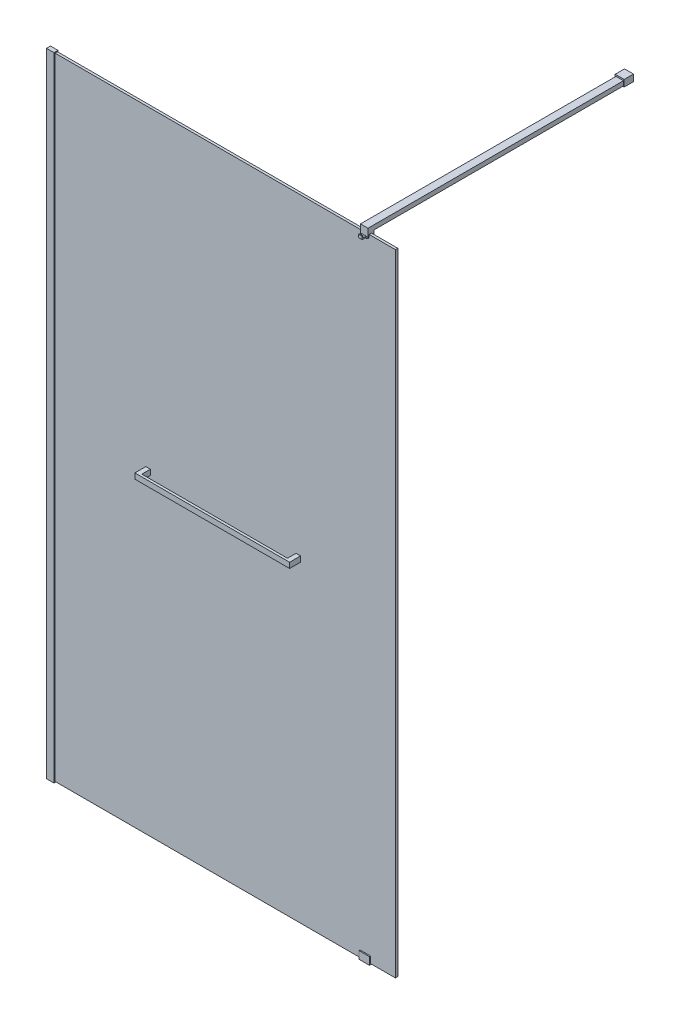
ISO-10303-21;
HEADER;
FILE_DESCRIPTION(('STEP AP214'),'2;1');
FILE_NAME('part.step','',(''),(''),'','','');
FILE_SCHEMA(('AUTOMOTIVE_DESIGN { 1 0 10303 214 1 1 1 1 }'));
ENDSEC;
DATA;
#1=APPLICATION_CONTEXT('core data for automotive mechanical design processes');
#2=APPLICATION_PROTOCOL_DEFINITION('international standard','automotive_design',2000,#1);
#3=PRODUCT_CONTEXT('',#1,'mechanical');
#4=PRODUCT('Part','Part','',(#3));
#5=PRODUCT_RELATED_PRODUCT_CATEGORY('part','',(#4));
#6=PRODUCT_DEFINITION_FORMATION('','',#4);
#7=PRODUCT_DEFINITION_CONTEXT('part definition',#1,'design');
#8=PRODUCT_DEFINITION('design','',#6,#7);
#9=PRODUCT_DEFINITION_SHAPE('','',#8);
#10=(LENGTH_UNIT() NAMED_UNIT(*) SI_UNIT(.MILLI.,.METRE.));
#11=(NAMED_UNIT(*) PLANE_ANGLE_UNIT() SI_UNIT($,.RADIAN.));
#12=(NAMED_UNIT(*) SI_UNIT($,.STERADIAN.) SOLID_ANGLE_UNIT());
#13=UNCERTAINTY_MEASURE_WITH_UNIT(LENGTH_MEASURE(1.E-05),#10,'distance_accuracy_value','');
#14=(GEOMETRIC_REPRESENTATION_CONTEXT(3) GLOBAL_UNCERTAINTY_ASSIGNED_CONTEXT((#13)) GLOBAL_UNIT_ASSIGNED_CONTEXT((#10,
#11,#12)) REPRESENTATION_CONTEXT('',''));
#15=CARTESIAN_POINT('',(0.,0.,0.));
#16=DIRECTION('',(0.,0.,1.));
#17=DIRECTION('',(1.,0.,0.));
#18=AXIS2_PLACEMENT_3D('',#15,#16,#17);
#19=CARTESIAN_POINT('',(842.45,1045.72,-21.6));
#20=DIRECTION('',(1.,0.,0.));
#21=DIRECTION('',(0.,0.,-1.));
#22=AXIS2_PLACEMENT_3D('',#19,#20,#21);
#23=PLANE('',#22);
#24=DIRECTION('',(0.,0.,-1.));
#25=VECTOR('',#24,1.);
#26=CARTESIAN_POINT('',(842.45,1053.72,-21.6));
#27=LINE('',#26,#25);
#28=CARTESIAN_POINT('',(842.45,1053.72,-21.6));
#29=VERTEX_POINT('',#28);
#30=CARTESIAN_POINT('',(842.45,1053.72,-101.6));
#31=VERTEX_POINT('',#30);
#32=EDGE_CURVE('E110',#29,#31,#27,.T.);
#33=ORIENTED_EDGE('',*,*,#32,.F.);
#34=DIRECTION('',(0.,1.,0.));
#35=VECTOR('',#34,1.);
#36=CARTESIAN_POINT('',(842.45,1045.72,-21.6));
#37=LINE('',#36,#35);
#38=CARTESIAN_POINT('',(842.45,1045.72,-21.6));
#39=VERTEX_POINT('',#38);
#40=EDGE_CURVE('E12',#39,#29,#37,.T.);
#41=ORIENTED_EDGE('',*,*,#40,.F.);
#42=DIRECTION('',(0.,0.,-1.));
#43=VECTOR('',#42,1.);
#44=CARTESIAN_POINT('',(842.45,1045.72,-21.6));
#45=LINE('',#44,#43);
#46=CARTESIAN_POINT('',(842.45,1045.72,-101.6));
#47=VERTEX_POINT('',#46);
#48=EDGE_CURVE('E104',#39,#47,#45,.T.);
#49=ORIENTED_EDGE('',*,*,#48,.T.);
#50=DIRECTION('',(0.,1.,0.));
#51=VECTOR('',#50,1.);
#52=CARTESIAN_POINT('',(842.45,1045.72,-101.6));
#53=LINE('',#52,#51);
#54=EDGE_CURVE('E49',#47,#31,#53,.T.);
#55=ORIENTED_EDGE('',*,*,#54,.T.);
#56=EDGE_LOOP('',(#33,#41,#49,#55));
#57=FACE_BOUND('',#56,.T.);
#58=ADVANCED_FACE('F46',(#57),#23,.T.);
#59=CARTESIAN_POINT('',(842.45,1045.72,-21.6));
#60=DIRECTION('',(0.,0.,1.));
#61=DIRECTION('',(1.,0.,0.));
#62=AXIS2_PLACEMENT_3D('',#59,#60,#61);
#63=PLANE('',#62);
#64=DIRECTION('',(1.,0.,0.));
#65=VECTOR('',#64,1.);
#66=CARTESIAN_POINT('',(842.45,1053.72,-21.6));
#67=LINE('',#66,#65);
#68=CARTESIAN_POINT('',(327.45,1053.72,-21.5999999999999));
#69=VERTEX_POINT('',#68);
#70=EDGE_CURVE('E106',#69,#29,#67,.T.);
#71=ORIENTED_EDGE('',*,*,#70,.F.);
#72=DIRECTION('',(0.,1.,0.));
#73=VECTOR('',#72,1.);
#74=CARTESIAN_POINT('',(327.45,1045.72,-21.5999999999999));
#75=LINE('',#74,#73);
#76=CARTESIAN_POINT('',(327.45,1045.72,-21.5999999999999));
#77=VERTEX_POINT('',#76);
#78=EDGE_CURVE('E55',#77,#69,#75,.T.);
#79=ORIENTED_EDGE('',*,*,#78,.F.);
#80=DIRECTION('',(1.,0.,0.));
#81=VECTOR('',#80,1.);
#82=CARTESIAN_POINT('',(842.45,1045.72,-21.6));
#83=LINE('',#82,#81);
#84=EDGE_CURVE('E101',#77,#39,#83,.T.);
#85=ORIENTED_EDGE('',*,*,#84,.T.);
#86=ORIENTED_EDGE('',*,*,#40,.T.);
#87=EDGE_LOOP('',(#71,#79,#85,#86));
#88=FACE_BOUND('',#87,.T.);
#89=ADVANCED_FACE('F120',(#88),#63,.T.);
#90=CARTESIAN_POINT('',(327.45,1045.72,-21.5999999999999));
#91=DIRECTION('',(-1.,0.,0.));
#92=DIRECTION('',(0.,0.,1.));
#93=AXIS2_PLACEMENT_3D('',#90,#91,#92);
#94=PLANE('',#93);
#95=DIRECTION('',(0.,0.,1.));
#96=VECTOR('',#95,1.);
#97=CARTESIAN_POINT('',(327.45,1053.72,-21.5999999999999));
#98=LINE('',#97,#96);
#99=CARTESIAN_POINT('',(327.45,1053.72,-101.6));
#100=VERTEX_POINT('',#99);
#101=EDGE_CURVE('E96',#100,#69,#98,.T.);
#102=ORIENTED_EDGE('',*,*,#101,.F.);
#103=DIRECTION('',(0.,1.,0.));
#104=VECTOR('',#103,1.);
#105=CARTESIAN_POINT('',(327.45,1045.72,-101.6));
#106=LINE('',#105,#104);
#107=CARTESIAN_POINT('',(327.45,1045.72,-101.6));
#108=VERTEX_POINT('',#107);
#109=EDGE_CURVE('E91',#108,#100,#106,.T.);
#110=ORIENTED_EDGE('',*,*,#109,.F.);
#111=DIRECTION('',(0.,0.,1.));
#112=VECTOR('',#111,1.);
#113=CARTESIAN_POINT('',(327.45,1045.72,-21.5999999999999));
#114=LINE('',#113,#112);
#115=EDGE_CURVE('E94',#108,#77,#114,.T.);
#116=ORIENTED_EDGE('',*,*,#115,.T.);
#117=ORIENTED_EDGE('',*,*,#78,.T.);
#118=EDGE_LOOP('',(#102,#110,#116,#117));
#119=FACE_BOUND('',#118,.T.);
#120=ADVANCED_FACE('F93',(#119),#94,.T.);
#121=CARTESIAN_POINT('',(842.45,1045.72,-101.6));
#122=DIRECTION('',(0.,0.,-1.));
#123=DIRECTION('',(-1.,0.,0.));
#124=AXIS2_PLACEMENT_3D('',#121,#122,#123);
#125=PLANE('',#124);
#126=DIRECTION('',(-1.,0.,0.));
#127=VECTOR('',#126,1.);
#128=CARTESIAN_POINT('',(842.45,1053.72,-101.6));
#129=LINE('',#128,#127);
#130=EDGE_CURVE('E113',#31,#100,#129,.T.);
#131=ORIENTED_EDGE('',*,*,#130,.F.);
#132=ORIENTED_EDGE('',*,*,#54,.F.);
#133=DIRECTION('',(-1.,0.,0.));
#134=VECTOR('',#133,1.);
#135=CARTESIAN_POINT('',(842.45,1045.72,-101.6));
#136=LINE('',#135,#134);
#137=EDGE_CURVE('E100',#47,#108,#136,.T.);
#138=ORIENTED_EDGE('',*,*,#137,.T.);
#139=ORIENTED_EDGE('',*,*,#109,.T.);
#140=EDGE_LOOP('',(#131,#132,#138,#139));
#141=FACE_BOUND('',#140,.T.);
#142=ADVANCED_FACE('F103',(#141),#125,.T.);
#143=CARTESIAN_POINT('',(842.45,1045.72,-101.6));
#144=DIRECTION('',(0.,1.,0.));
#145=DIRECTION('',(0.,0.,1.));
#146=AXIS2_PLACEMENT_3D('',#143,#144,#145);
#147=PLANE('',#146);
#148=ORIENTED_EDGE('',*,*,#48,.F.);
#149=ORIENTED_EDGE('',*,*,#84,.F.);
#150=ORIENTED_EDGE('',*,*,#115,.F.);
#151=ORIENTED_EDGE('',*,*,#137,.F.);
#152=EDGE_LOOP('',(#148,#149,#150,#151));
#153=FACE_BOUND('',#152,.T.);
#154=ADVANCED_FACE('F99',(#153),#147,.F.);
#155=CARTESIAN_POINT('',(842.45,1053.72,-101.6));
#156=DIRECTION('',(0.,1.,0.));
#157=DIRECTION('',(0.,0.,1.));
#158=AXIS2_PLACEMENT_3D('',#155,#156,#157);
#159=PLANE('',#158);
#160=ORIENTED_EDGE('',*,*,#32,.T.);
#161=ORIENTED_EDGE('',*,*,#130,.T.);
#162=ORIENTED_EDGE('',*,*,#101,.T.);
#163=ORIENTED_EDGE('',*,*,#70,.T.);
#164=EDGE_LOOP('',(#160,#161,#162,#163));
#165=FACE_BOUND('',#164,.T.);
#166=ADVANCED_FACE('F119',(#165),#159,.T.);
#167=CLOSED_SHELL('',(#58,#89,#120,#142,#154,#166));
#168=MANIFOLD_SOLID_BREP('B2',#167);
#169=CARTESIAN_POINT('',(342.45,1041.,-34.4));
#170=DIRECTION('',(0.,0.,1.));
#171=DIRECTION('',(1.,0.,0.));
#172=AXIS2_PLACEMENT_3D('',#169,#170,#171);
#173=PLANE('',#172);
#174=DIRECTION('',(0.,-1.,0.));
#175=VECTOR('',#174,1.);
#176=CARTESIAN_POINT('',(327.45,1059.,-34.4));
#177=LINE('',#176,#175);
#178=CARTESIAN_POINT('',(327.45,1045.73,-34.4));
#179=VERTEX_POINT('',#178);
#180=CARTESIAN_POINT('',(327.45,1041.,-34.4));
#181=VERTEX_POINT('',#180);
#182=EDGE_CURVE('E415',#179,#181,#177,.T.);
#183=ORIENTED_EDGE('',*,*,#182,.F.);
#184=DIRECTION('',(1.,0.,0.));
#185=VECTOR('',#184,1.);
#186=CARTESIAN_POINT('',(342.45,1045.73,-34.4));
#187=LINE('',#186,#185);
#188=CARTESIAN_POINT('',(342.45,1045.73,-34.4));
#189=VERTEX_POINT('',#188);
#190=EDGE_CURVE('E44',#179,#189,#187,.T.);
#191=ORIENTED_EDGE('',*,*,#190,.T.);
#192=DIRECTION('',(0.,1.,0.));
#193=VECTOR('',#192,1.);
#194=CARTESIAN_POINT('',(342.45,1059.,-34.4));
#195=LINE('',#194,#193);
#196=CARTESIAN_POINT('',(342.45,1041.,-34.4));
#197=VERTEX_POINT('',#196);
#198=EDGE_CURVE('E420',#197,#189,#195,.T.);
#199=ORIENTED_EDGE('',*,*,#198,.F.);
#200=DIRECTION('',(1.,0.,0.));
#201=VECTOR('',#200,1.);
#202=CARTESIAN_POINT('',(327.45,1041.,-34.4));
#203=LINE('',#202,#201);
#204=EDGE_CURVE('E394',#181,#197,#203,.T.);
#205=ORIENTED_EDGE('',*,*,#204,.F.);
#206=EDGE_LOOP('',(#183,#191,#199,#205));
#207=FACE_BOUND('',#206,.T.);
#208=ADVANCED_FACE('F180',(#207),#173,.F.);
#209=CARTESIAN_POINT('',(342.45,1059.,-34.4));
#210=DIRECTION('',(1.,0.,0.));
#211=DIRECTION('',(0.,0.,-1.));
#212=AXIS2_PLACEMENT_3D('',#209,#210,#211);
#213=PLANE('',#212);
#214=DIRECTION('',(0.,1.,0.));
#215=VECTOR('',#214,1.);
#216=CARTESIAN_POINT('',(342.45,1059.,25.1));
#217=LINE('',#216,#215);
#218=CARTESIAN_POINT('',(342.45,1041.,25.1));
#219=VERTEX_POINT('',#218);
#220=CARTESIAN_POINT('',(342.45,1059.,25.1));
#221=VERTEX_POINT('',#220);
#222=EDGE_CURVE('E198',#219,#221,#217,.T.);
#223=ORIENTED_EDGE('',*,*,#222,.F.);
#224=DIRECTION('',(0.,0.,1.));
#225=VECTOR('',#224,1.);
#226=CARTESIAN_POINT('',(342.45,1041.,-34.4));
#227=LINE('',#226,#225);
#228=EDGE_CURVE('E385',#197,#219,#227,.T.);
#229=ORIENTED_EDGE('',*,*,#228,.F.);
#230=ORIENTED_EDGE('',*,*,#198,.T.);
#231=DIRECTION('',(0.,0.,-1.));
#232=VECTOR('',#231,1.);
#233=CARTESIAN_POINT('',(342.45,1045.73,-34.4));
#234=LINE('',#233,#232);
#235=CARTESIAN_POINT('',(342.45,1045.73,-21.6));
#236=VERTEX_POINT('',#235);
#237=EDGE_CURVE('E433',#236,#189,#234,.T.);
#238=ORIENTED_EDGE('',*,*,#237,.F.);
#239=DIRECTION('',(0.,-1.,0.));
#240=VECTOR('',#239,1.);
#241=CARTESIAN_POINT('',(342.45,1059.,-21.6));
#242=LINE('',#241,#240);
#243=CARTESIAN_POINT('',(342.45,1053.73,-21.6));
#244=VERTEX_POINT('',#243);
#245=EDGE_CURVE('E431',#244,#236,#242,.T.);
#246=ORIENTED_EDGE('',*,*,#245,.F.);
#247=DIRECTION('',(0.,0.,1.));
#248=VECTOR('',#247,1.);
#249=CARTESIAN_POINT('',(342.45,1053.73,-34.4));
#250=LINE('',#249,#248);
#251=CARTESIAN_POINT('',(342.45,1053.73,-34.4));
#252=VERTEX_POINT('',#251);
#253=EDGE_CURVE('E435',#252,#244,#250,.T.);
#254=ORIENTED_EDGE('',*,*,#253,.F.);
#255=CARTESIAN_POINT('',(342.45,1059.,-34.4));
#256=VERTEX_POINT('',#255);
#257=EDGE_CURVE('E408',#252,#256,#195,.T.);
#258=ORIENTED_EDGE('',*,*,#257,.T.);
#259=DIRECTION('',(0.,0.,1.));
#260=VECTOR('',#259,1.);
#261=CARTESIAN_POINT('',(342.45,1059.,-34.4));
#262=LINE('',#261,#260);
#263=EDGE_CURVE('E389',#256,#221,#262,.T.);
#264=ORIENTED_EDGE('',*,*,#263,.T.);
#265=EDGE_LOOP('',(#223,#229,#230,#238,#246,#254,#258,#264));
#266=FACE_BOUND('',#265,.T.);
#267=ADVANCED_FACE('F182',(#266),#213,.T.);
#268=CARTESIAN_POINT('',(327.45,1041.,-34.4));
#269=DIRECTION('',(0.,-1.,0.));
#270=DIRECTION('',(0.,0.,-1.));
#271=AXIS2_PLACEMENT_3D('',#268,#269,#270);
#272=PLANE('',#271);
#273=ORIENTED_EDGE('',*,*,#228,.T.);
#274=DIRECTION('',(-1.,0.,0.));
#275=VECTOR('',#274,1.);
#276=CARTESIAN_POINT('',(847.147715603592,1041.,25.1));
#277=LINE('',#276,#275);
#278=CARTESIAN_POINT('',(827.45,1041.,25.1));
#279=VERTEX_POINT('',#278);
#280=EDGE_CURVE('E373',#279,#219,#277,.T.);
#281=ORIENTED_EDGE('',*,*,#280,.F.);
#282=DIRECTION('',(0.,0.,1.));
#283=VECTOR('',#282,1.);
#284=CARTESIAN_POINT('',(827.45,1041.,-34.4));
#285=LINE('',#284,#283);
#286=CARTESIAN_POINT('',(827.45,1041.,-34.4));
#287=VERTEX_POINT('',#286);
#288=EDGE_CURVE('E352',#287,#279,#285,.T.);
#289=ORIENTED_EDGE('',*,*,#288,.F.);
#290=DIRECTION('',(1.,0.,0.));
#291=VECTOR('',#290,1.);
#292=CARTESIAN_POINT('',(827.45,1041.,-34.4));
#293=LINE('',#292,#291);
#294=CARTESIAN_POINT('',(842.45,1041.,-34.4));
#295=VERTEX_POINT('',#294);
#296=EDGE_CURVE('E344',#287,#295,#293,.T.);
#297=ORIENTED_EDGE('',*,*,#296,.T.);
#298=DIRECTION('',(0.,0.,1.));
#299=VECTOR('',#298,1.);
#300=CARTESIAN_POINT('',(842.45,1041.,-34.4));
#301=LINE('',#300,#299);
#302=CARTESIAN_POINT('',(842.45,1041.,33.1));
#303=VERTEX_POINT('',#302);
#304=EDGE_CURVE('E348',#295,#303,#301,.T.);
#305=ORIENTED_EDGE('',*,*,#304,.T.);
#306=DIRECTION('',(1.,0.,0.));
#307=VECTOR('',#306,1.);
#308=CARTESIAN_POINT('',(327.45,1041.,33.1));
#309=LINE('',#308,#307);
#310=CARTESIAN_POINT('',(327.45,1041.,33.1));
#311=VERTEX_POINT('',#310);
#312=EDGE_CURVE('E423',#311,#303,#309,.T.);
#313=ORIENTED_EDGE('',*,*,#312,.F.);
#314=DIRECTION('',(0.,0.,1.));
#315=VECTOR('',#314,1.);
#316=CARTESIAN_POINT('',(327.45,1041.,-34.4));
#317=LINE('',#316,#315);
#318=EDGE_CURVE('E388',#181,#311,#317,.T.);
#319=ORIENTED_EDGE('',*,*,#318,.F.);
#320=ORIENTED_EDGE('',*,*,#204,.T.);
#321=EDGE_LOOP('',(#273,#281,#289,#297,#305,#313,#319,#320));
#322=FACE_BOUND('',#321,.T.);
#323=ADVANCED_FACE('F456',(#322),#272,.T.);
#324=CARTESIAN_POINT('',(327.45,1059.,-34.4));
#325=DIRECTION('',(-1.,0.,0.));
#326=DIRECTION('',(0.,0.,1.));
#327=AXIS2_PLACEMENT_3D('',#324,#325,#326);
#328=PLANE('',#327);
#329=DIRECTION('',(0.,0.,1.));
#330=VECTOR('',#329,1.);
#331=CARTESIAN_POINT('',(327.45,1045.73,-34.4));
#332=LINE('',#331,#330);
#333=CARTESIAN_POINT('',(327.45,1045.73,-21.6));
#334=VERTEX_POINT('',#333);
#335=EDGE_CURVE('E379',#179,#334,#332,.T.);
#336=ORIENTED_EDGE('',*,*,#335,.F.);
#337=ORIENTED_EDGE('',*,*,#182,.T.);
#338=ORIENTED_EDGE('',*,*,#318,.T.);
#339=DIRECTION('',(0.,-1.,0.));
#340=VECTOR('',#339,1.);
#341=CARTESIAN_POINT('',(327.45,1059.,33.1));
#342=LINE('',#341,#340);
#343=CARTESIAN_POINT('',(327.45,1059.,33.1));
#344=VERTEX_POINT('',#343);
#345=EDGE_CURVE('E425',#344,#311,#342,.T.);
#346=ORIENTED_EDGE('',*,*,#345,.F.);
#347=DIRECTION('',(0.,0.,1.));
#348=VECTOR('',#347,1.);
#349=CARTESIAN_POINT('',(327.45,1059.,-34.4));
#350=LINE('',#349,#348);
#351=CARTESIAN_POINT('',(327.45,1059.,-34.4));
#352=VERTEX_POINT('',#351);
#353=EDGE_CURVE('E397',#352,#344,#350,.T.);
#354=ORIENTED_EDGE('',*,*,#353,.F.);
#355=CARTESIAN_POINT('',(327.45,1053.73,-34.4));
#356=VERTEX_POINT('',#355);
#357=EDGE_CURVE('E406',#352,#356,#177,.T.);
#358=ORIENTED_EDGE('',*,*,#357,.T.);
#359=DIRECTION('',(0.,0.,-1.));
#360=VECTOR('',#359,1.);
#361=CARTESIAN_POINT('',(327.45,1053.73,-34.4));
#362=LINE('',#361,#360);
#363=CARTESIAN_POINT('',(327.45,1053.73,-21.6));
#364=VERTEX_POINT('',#363);
#365=EDGE_CURVE('E206',#364,#356,#362,.T.);
#366=ORIENTED_EDGE('',*,*,#365,.F.);
#367=DIRECTION('',(0.,1.,0.));
#368=VECTOR('',#367,1.);
#369=CARTESIAN_POINT('',(327.45,1053.73,-21.6));
#370=LINE('',#369,#368);
#371=EDGE_CURVE('E442',#334,#364,#370,.T.);
#372=ORIENTED_EDGE('',*,*,#371,.F.);
#373=EDGE_LOOP('',(#336,#337,#338,#346,#354,#358,#366,#372));
#374=FACE_BOUND('',#373,.T.);
#375=ADVANCED_FACE('F412',(#374),#328,.T.);
#376=CARTESIAN_POINT('',(327.45,1059.,-34.4));
#377=DIRECTION('',(0.,1.,0.));
#378=DIRECTION('',(0.,0.,1.));
#379=AXIS2_PLACEMENT_3D('',#376,#377,#378);
#380=PLANE('',#379);
#381=ORIENTED_EDGE('',*,*,#353,.T.);
#382=DIRECTION('',(-1.,0.,0.));
#383=VECTOR('',#382,1.);
#384=CARTESIAN_POINT('',(327.45,1059.,33.1));
#385=LINE('',#384,#383);
#386=CARTESIAN_POINT('',(842.45,1059.,33.1));
#387=VERTEX_POINT('',#386);
#388=EDGE_CURVE('E428',#387,#344,#385,.T.);
#389=ORIENTED_EDGE('',*,*,#388,.F.);
#390=DIRECTION('',(0.,0.,1.));
#391=VECTOR('',#390,1.);
#392=CARTESIAN_POINT('',(842.45,1059.,-34.4));
#393=LINE('',#392,#391);
#394=CARTESIAN_POINT('',(842.45,1059.,-34.4));
#395=VERTEX_POINT('',#394);
#396=EDGE_CURVE('E347',#395,#387,#393,.T.);
#397=ORIENTED_EDGE('',*,*,#396,.F.);
#398=DIRECTION('',(-1.,0.,0.));
#399=VECTOR('',#398,1.);
#400=CARTESIAN_POINT('',(827.45,1059.,-34.4));
#401=LINE('',#400,#399);
#402=CARTESIAN_POINT('',(827.45,1059.,-34.4));
#403=VERTEX_POINT('',#402);
#404=EDGE_CURVE('E337',#395,#403,#401,.T.);
#405=ORIENTED_EDGE('',*,*,#404,.T.);
#406=DIRECTION('',(0.,0.,1.));
#407=VECTOR('',#406,1.);
#408=CARTESIAN_POINT('',(827.45,1059.,-34.4));
#409=LINE('',#408,#407);
#410=CARTESIAN_POINT('',(827.45,1059.,25.1));
#411=VERTEX_POINT('',#410);
#412=EDGE_CURVE('E360',#403,#411,#409,.T.);
#413=ORIENTED_EDGE('',*,*,#412,.T.);
#414=DIRECTION('',(-1.,0.,0.));
#415=VECTOR('',#414,1.);
#416=CARTESIAN_POINT('',(847.147715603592,1059.,25.1));
#417=LINE('',#416,#415);
#418=EDGE_CURVE('E370',#411,#221,#417,.T.);
#419=ORIENTED_EDGE('',*,*,#418,.T.);
#420=ORIENTED_EDGE('',*,*,#263,.F.);
#421=DIRECTION('',(-1.,0.,0.));
#422=VECTOR('',#421,1.);
#423=CARTESIAN_POINT('',(327.45,1059.,-34.4));
#424=LINE('',#423,#422);
#425=EDGE_CURVE('E417',#256,#352,#424,.T.);
#426=ORIENTED_EDGE('',*,*,#425,.T.);
#427=EDGE_LOOP('',(#381,#389,#397,#405,#413,#419,#420,#426));
#428=FACE_BOUND('',#427,.T.);
#429=ADVANCED_FACE('F463',(#428),#380,.T.);
#430=ORIENTED_EDGE('',*,*,#257,.F.);
#431=DIRECTION('',(-1.,0.,0.));
#432=VECTOR('',#431,1.);
#433=CARTESIAN_POINT('',(342.45,1053.73,-34.4));
#434=LINE('',#433,#432);
#435=EDGE_CURVE('E190',#252,#356,#434,.T.);
#436=ORIENTED_EDGE('',*,*,#435,.T.);
#437=ORIENTED_EDGE('',*,*,#357,.F.);
#438=ORIENTED_EDGE('',*,*,#425,.F.);
#439=EDGE_LOOP('',(#430,#436,#437,#438));
#440=FACE_BOUND('',#439,.T.);
#441=ADVANCED_FACE('F404',(#440),#173,.F.);
#442=CARTESIAN_POINT('',(342.45,1041.,33.1));
#443=DIRECTION('',(0.,0.,1.));
#444=DIRECTION('',(1.,0.,0.));
#445=AXIS2_PLACEMENT_3D('',#442,#443,#444);
#446=PLANE('',#445);
#447=ORIENTED_EDGE('',*,*,#312,.T.);
#448=DIRECTION('',(0.,1.,0.));
#449=VECTOR('',#448,1.);
#450=CARTESIAN_POINT('',(842.45,1059.,33.1));
#451=LINE('',#450,#449);
#452=EDGE_CURVE('E332',#303,#387,#451,.T.);
#453=ORIENTED_EDGE('',*,*,#452,.T.);
#454=ORIENTED_EDGE('',*,*,#388,.T.);
#455=ORIENTED_EDGE('',*,*,#345,.T.);
#456=EDGE_LOOP('',(#447,#453,#454,#455));
#457=FACE_BOUND('',#456,.T.);
#458=ADVANCED_FACE('F459',(#457),#446,.T.);
#459=CARTESIAN_POINT('',(857.544369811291,1045.73,-34.4));
#460=DIRECTION('',(0.,-1.,0.));
#461=DIRECTION('',(0.,0.,-1.));
#462=AXIS2_PLACEMENT_3D('',#459,#460,#461);
#463=PLANE('',#462);
#464=ORIENTED_EDGE('',*,*,#237,.T.);
#465=ORIENTED_EDGE('',*,*,#190,.F.);
#466=ORIENTED_EDGE('',*,*,#335,.T.);
#467=DIRECTION('',(-1.,0.,0.));
#468=VECTOR('',#467,1.);
#469=CARTESIAN_POINT('',(857.544369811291,1045.73,-21.6));
#470=LINE('',#469,#468);
#471=EDGE_CURVE('E438',#236,#334,#470,.T.);
#472=ORIENTED_EDGE('',*,*,#471,.F.);
#473=EDGE_LOOP('',(#464,#465,#466,#472));
#474=FACE_BOUND('',#473,.T.);
#475=ADVANCED_FACE('F498',(#474),#463,.F.);
#476=CARTESIAN_POINT('',(857.544369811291,1053.73,-21.6));
#477=DIRECTION('',(0.,0.,1.));
#478=DIRECTION('',(1.,0.,0.));
#479=AXIS2_PLACEMENT_3D('',#476,#477,#478);
#480=PLANE('',#479);
#481=ORIENTED_EDGE('',*,*,#245,.T.);
#482=ORIENTED_EDGE('',*,*,#471,.T.);
#483=ORIENTED_EDGE('',*,*,#371,.T.);
#484=DIRECTION('',(-1.,0.,0.));
#485=VECTOR('',#484,1.);
#486=CARTESIAN_POINT('',(857.544369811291,1053.73,-21.6));
#487=LINE('',#486,#485);
#488=EDGE_CURVE('E437',#244,#364,#487,.T.);
#489=ORIENTED_EDGE('',*,*,#488,.F.);
#490=EDGE_LOOP('',(#481,#482,#483,#489));
#491=FACE_BOUND('',#490,.T.);
#492=ADVANCED_FACE('F446',(#491),#480,.F.);
#493=CARTESIAN_POINT('',(857.544369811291,1053.73,-34.4));
#494=DIRECTION('',(0.,1.,0.));
#495=DIRECTION('',(0.,0.,1.));
#496=AXIS2_PLACEMENT_3D('',#493,#494,#495);
#497=PLANE('',#496);
#498=ORIENTED_EDGE('',*,*,#253,.T.);
#499=ORIENTED_EDGE('',*,*,#488,.T.);
#500=ORIENTED_EDGE('',*,*,#365,.T.);
#501=ORIENTED_EDGE('',*,*,#435,.F.);
#502=EDGE_LOOP('',(#498,#499,#500,#501));
#503=FACE_BOUND('',#502,.T.);
#504=ADVANCED_FACE('F538',(#503),#497,.F.);
#505=CARTESIAN_POINT('',(847.147715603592,1059.,25.1));
#506=DIRECTION('',(0.,0.,1.));
#507=DIRECTION('',(0.,-1.,0.));
#508=AXIS2_PLACEMENT_3D('',#505,#506,#507);
#509=PLANE('',#508);
#510=ORIENTED_EDGE('',*,*,#418,.F.);
#511=DIRECTION('',(0.,-1.,0.));
#512=VECTOR('',#511,1.);
#513=CARTESIAN_POINT('',(827.45,1059.,25.1));
#514=LINE('',#513,#512);
#515=EDGE_CURVE('E184',#411,#279,#514,.T.);
#516=ORIENTED_EDGE('',*,*,#515,.T.);
#517=ORIENTED_EDGE('',*,*,#280,.T.);
#518=ORIENTED_EDGE('',*,*,#222,.T.);
#519=EDGE_LOOP('',(#510,#516,#517,#518));
#520=FACE_BOUND('',#519,.T.);
#521=ADVANCED_FACE('F470',(#520),#509,.F.);
#522=CARTESIAN_POINT('',(827.45,1059.,-34.4));
#523=DIRECTION('',(-1.,0.,0.));
#524=DIRECTION('',(0.,0.,1.));
#525=AXIS2_PLACEMENT_3D('',#522,#523,#524);
#526=PLANE('',#525);
#527=ORIENTED_EDGE('',*,*,#515,.F.);
#528=ORIENTED_EDGE('',*,*,#412,.F.);
#529=DIRECTION('',(0.,-1.,0.));
#530=VECTOR('',#529,1.);
#531=CARTESIAN_POINT('',(827.45,1059.,-34.4));
#532=LINE('',#531,#530);
#533=CARTESIAN_POINT('',(827.45,1053.73,-34.4));
#534=VERTEX_POINT('',#533);
#535=EDGE_CURVE('E341',#403,#534,#532,.T.);
#536=ORIENTED_EDGE('',*,*,#535,.T.);
#537=DIRECTION('',(0.,0.,-1.));
#538=VECTOR('',#537,1.);
#539=CARTESIAN_POINT('',(827.45,1053.73,-34.4));
#540=LINE('',#539,#538);
#541=CARTESIAN_POINT('',(827.45,1053.73,-21.6));
#542=VERTEX_POINT('',#541);
#543=EDGE_CURVE('E329',#542,#534,#540,.T.);
#544=ORIENTED_EDGE('',*,*,#543,.F.);
#545=DIRECTION('',(0.,1.,0.));
#546=VECTOR('',#545,1.);
#547=CARTESIAN_POINT('',(827.45,1059.,-21.6));
#548=LINE('',#547,#546);
#549=CARTESIAN_POINT('',(827.45,1045.73,-21.6));
#550=VERTEX_POINT('',#549);
#551=EDGE_CURVE('E351',#550,#542,#548,.T.);
#552=ORIENTED_EDGE('',*,*,#551,.F.);
#553=DIRECTION('',(0.,0.,1.));
#554=VECTOR('',#553,1.);
#555=CARTESIAN_POINT('',(827.45,1045.73,-34.4));
#556=LINE('',#555,#554);
#557=CARTESIAN_POINT('',(827.45,1045.73,-34.4));
#558=VERTEX_POINT('',#557);
#559=EDGE_CURVE('E313',#558,#550,#556,.T.);
#560=ORIENTED_EDGE('',*,*,#559,.F.);
#561=EDGE_CURVE('E340',#558,#287,#532,.T.);
#562=ORIENTED_EDGE('',*,*,#561,.T.);
#563=ORIENTED_EDGE('',*,*,#288,.T.);
#564=EDGE_LOOP('',(#527,#528,#536,#544,#552,#560,#562,#563));
#565=FACE_BOUND('',#564,.T.);
#566=ADVANCED_FACE('F471',(#565),#526,.T.);
#567=CARTESIAN_POINT('',(842.45,1041.,-34.4));
#568=DIRECTION('',(0.,0.,1.));
#569=DIRECTION('',(1.,0.,0.));
#570=AXIS2_PLACEMENT_3D('',#567,#568,#569);
#571=PLANE('',#570);
#572=ORIENTED_EDGE('',*,*,#561,.F.);
#573=DIRECTION('',(-1.,0.,0.));
#574=VECTOR('',#573,1.);
#575=CARTESIAN_POINT('',(857.544369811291,1045.73,-34.4));
#576=LINE('',#575,#574);
#577=CARTESIAN_POINT('',(842.45,1045.73,-34.4));
#578=VERTEX_POINT('',#577);
#579=EDGE_CURVE('E326',#578,#558,#576,.T.);
#580=ORIENTED_EDGE('',*,*,#579,.F.);
#581=DIRECTION('',(0.,1.,0.));
#582=VECTOR('',#581,1.);
#583=CARTESIAN_POINT('',(842.45,1059.,-34.4));
#584=LINE('',#583,#582);
#585=EDGE_CURVE('E318',#295,#578,#584,.T.);
#586=ORIENTED_EDGE('',*,*,#585,.F.);
#587=ORIENTED_EDGE('',*,*,#296,.F.);
#588=EDGE_LOOP('',(#572,#580,#586,#587));
#589=FACE_BOUND('',#588,.T.);
#590=ADVANCED_FACE('F476',(#589),#571,.F.);
#591=CARTESIAN_POINT('',(842.45,1059.,-34.4));
#592=DIRECTION('',(1.,0.,0.));
#593=DIRECTION('',(0.,0.,-1.));
#594=AXIS2_PLACEMENT_3D('',#591,#592,#593);
#595=PLANE('',#594);
#596=DIRECTION('',(0.,0.,1.));
#597=VECTOR('',#596,1.);
#598=CARTESIAN_POINT('',(842.45,1045.73,-34.4));
#599=LINE('',#598,#597);
#600=CARTESIAN_POINT('',(842.45,1045.73,-21.6));
#601=VERTEX_POINT('',#600);
#602=EDGE_CURVE('E310',#578,#601,#599,.T.);
#603=ORIENTED_EDGE('',*,*,#602,.T.);
#604=DIRECTION('',(0.,1.,0.));
#605=VECTOR('',#604,1.);
#606=CARTESIAN_POINT('',(842.45,1053.73,-21.6));
#607=LINE('',#606,#605);
#608=CARTESIAN_POINT('',(842.45,1053.73,-21.6));
#609=VERTEX_POINT('',#608);
#610=EDGE_CURVE('E297',#601,#609,#607,.T.);
#611=ORIENTED_EDGE('',*,*,#610,.T.);
#612=DIRECTION('',(0.,0.,-1.));
#613=VECTOR('',#612,1.);
#614=CARTESIAN_POINT('',(842.45,1053.73,-34.4));
#615=LINE('',#614,#613);
#616=CARTESIAN_POINT('',(842.45,1053.73,-34.4));
#617=VERTEX_POINT('',#616);
#618=EDGE_CURVE('E321',#609,#617,#615,.T.);
#619=ORIENTED_EDGE('',*,*,#618,.T.);
#620=EDGE_CURVE('E335',#617,#395,#584,.T.);
#621=ORIENTED_EDGE('',*,*,#620,.T.);
#622=ORIENTED_EDGE('',*,*,#396,.T.);
#623=ORIENTED_EDGE('',*,*,#452,.F.);
#624=ORIENTED_EDGE('',*,*,#304,.F.);
#625=ORIENTED_EDGE('',*,*,#585,.T.);
#626=EDGE_LOOP('',(#603,#611,#619,#621,#622,#623,#624,#625));
#627=FACE_BOUND('',#626,.T.);
#628=ADVANCED_FACE('F316',(#627),#595,.T.);
#629=ORIENTED_EDGE('',*,*,#620,.F.);
#630=DIRECTION('',(-1.,0.,0.));
#631=VECTOR('',#630,1.);
#632=CARTESIAN_POINT('',(857.544369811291,1053.73,-34.4));
#633=LINE('',#632,#631);
#634=EDGE_CURVE('E322',#617,#534,#633,.T.);
#635=ORIENTED_EDGE('',*,*,#634,.T.);
#636=ORIENTED_EDGE('',*,*,#535,.F.);
#637=ORIENTED_EDGE('',*,*,#404,.F.);
#638=EDGE_LOOP('',(#629,#635,#636,#637));
#639=FACE_BOUND('',#638,.T.);
#640=ADVANCED_FACE('F467',(#639),#571,.F.);
#641=CARTESIAN_POINT('',(857.544369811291,1045.73,-34.4));
#642=DIRECTION('',(0.,-1.,0.));
#643=DIRECTION('',(0.,0.,-1.));
#644=AXIS2_PLACEMENT_3D('',#641,#642,#643);
#645=PLANE('',#644);
#646=ORIENTED_EDGE('',*,*,#559,.T.);
#647=DIRECTION('',(-1.,0.,0.));
#648=VECTOR('',#647,1.);
#649=CARTESIAN_POINT('',(857.544369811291,1045.73,-21.6));
#650=LINE('',#649,#648);
#651=EDGE_CURVE('E300',#601,#550,#650,.T.);
#652=ORIENTED_EDGE('',*,*,#651,.F.);
#653=ORIENTED_EDGE('',*,*,#602,.F.);
#654=ORIENTED_EDGE('',*,*,#579,.T.);
#655=EDGE_LOOP('',(#646,#652,#653,#654));
#656=FACE_BOUND('',#655,.T.);
#657=ADVANCED_FACE('F309',(#656),#645,.F.);
#658=CARTESIAN_POINT('',(857.544369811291,1053.73,-21.6));
#659=DIRECTION('',(0.,0.,1.));
#660=DIRECTION('',(1.,0.,0.));
#661=AXIS2_PLACEMENT_3D('',#658,#659,#660);
#662=PLANE('',#661);
#663=ORIENTED_EDGE('',*,*,#551,.T.);
#664=DIRECTION('',(-1.,0.,0.));
#665=VECTOR('',#664,1.);
#666=CARTESIAN_POINT('',(857.544369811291,1053.73,-21.6));
#667=LINE('',#666,#665);
#668=EDGE_CURVE('E303',#609,#542,#667,.T.);
#669=ORIENTED_EDGE('',*,*,#668,.F.);
#670=ORIENTED_EDGE('',*,*,#610,.F.);
#671=ORIENTED_EDGE('',*,*,#651,.T.);
#672=EDGE_LOOP('',(#663,#669,#670,#671));
#673=FACE_BOUND('',#672,.T.);
#674=ADVANCED_FACE('F299',(#673),#662,.F.);
#675=CARTESIAN_POINT('',(857.544369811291,1053.73,-34.4));
#676=DIRECTION('',(0.,1.,0.));
#677=DIRECTION('',(0.,0.,1.));
#678=AXIS2_PLACEMENT_3D('',#675,#676,#677);
#679=PLANE('',#678);
#680=ORIENTED_EDGE('',*,*,#543,.T.);
#681=ORIENTED_EDGE('',*,*,#634,.F.);
#682=ORIENTED_EDGE('',*,*,#618,.F.);
#683=ORIENTED_EDGE('',*,*,#668,.T.);
#684=EDGE_LOOP('',(#680,#681,#682,#683));
#685=FACE_BOUND('',#684,.T.);
#686=ADVANCED_FACE('F479',(#685),#679,.F.);
#687=CLOSED_SHELL('',(#208,#267,#323,#375,#429,#441,#458,#475,#492,#504,#521,#566,#590,#628,
#640,#657,#674,#686));
#688=MANIFOLD_SOLID_BREP('B6',#687);
#689=CARTESIAN_POINT('',(1070.95,2090.,-19.4000000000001));
#690=DIRECTION('',(-1.,0.,0.));
#691=DIRECTION('',(0.,0.,1.));
#692=AXIS2_PLACEMENT_3D('',#689,#690,#691);
#693=PLANE('',#692);
#694=DIRECTION('',(0.,-1.,0.));
#695=VECTOR('',#694,1.);
#696=CARTESIAN_POINT('',(1070.95,2090.,-850.03));
#697=LINE('',#696,#695);
#698=CARTESIAN_POINT('',(1070.95,2120.,-850.03));
#699=VERTEX_POINT('',#698);
#700=CARTESIAN_POINT('',(1070.95,2105.,-850.03));
#701=VERTEX_POINT('',#700);
#702=EDGE_CURVE('E669',#699,#701,#697,.T.);
#703=ORIENTED_EDGE('',*,*,#702,.F.);
#704=DIRECTION('',(0.,0.,1.));
#705=VECTOR('',#704,1.);
#706=CARTESIAN_POINT('',(1070.95,2120.,0.599999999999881));
#707=LINE('',#706,#705);
#708=CARTESIAN_POINT('',(1070.95,2120.,0.599999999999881));
#709=VERTEX_POINT('',#708);
#710=EDGE_CURVE('E994',#699,#709,#707,.T.);
#711=ORIENTED_EDGE('',*,*,#710,.T.);
#712=DIRECTION('',(0.,-1.,0.));
#713=VECTOR('',#712,1.);
#714=CARTESIAN_POINT('',(1070.95,2094.,0.599999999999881));
#715=LINE('',#714,#713);
#716=CARTESIAN_POINT('',(1070.95,2094.,0.599999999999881));
#717=VERTEX_POINT('',#716);
#718=EDGE_CURVE('E996',#709,#717,#715,.T.);
#719=ORIENTED_EDGE('',*,*,#718,.T.);
#720=DIRECTION('',(0.,1.,0.));
#721=VECTOR('',#720,1.);
#722=CARTESIAN_POINT('',(1070.95,2090.,0.599999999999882));
#723=LINE('',#722,#721);
#724=CARTESIAN_POINT('',(1070.95,2090.,0.599999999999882));
#725=VERTEX_POINT('',#724);
#726=EDGE_CURVE('E940',#725,#717,#723,.T.);
#727=ORIENTED_EDGE('',*,*,#726,.F.);
#728=DIRECTION('',(0.,0.,-1.));
#729=VECTOR('',#728,1.);
#730=CARTESIAN_POINT('',(1070.95,2090.,-3.40000000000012));
#731=LINE('',#730,#729);
#732=CARTESIAN_POINT('',(1070.95,2090.,-3.40000000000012));
#733=VERTEX_POINT('',#732);
#734=EDGE_CURVE('E970',#725,#733,#731,.T.);
#735=ORIENTED_EDGE('',*,*,#734,.T.);
#736=DIRECTION('',(0.,1.,-1.30407837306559E-13));
#737=VECTOR('',#736,1.);
#738=CARTESIAN_POINT('',(1070.95,2100.,-3.40000000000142));
#739=LINE('',#738,#737);
#740=CARTESIAN_POINT('',(1070.95,2100.,-3.40000000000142));
#741=VERTEX_POINT('',#740);
#742=EDGE_CURVE('E1000',#733,#741,#739,.T.);
#743=ORIENTED_EDGE('',*,*,#742,.T.);
#744=DIRECTION('',(0.,0.,-1.));
#745=VECTOR('',#744,1.);
#746=CARTESIAN_POINT('',(1070.95,2100.,-11.4000000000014));
#747=LINE('',#746,#745);
#748=CARTESIAN_POINT('',(1070.95,2100.,-11.4000000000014));
#749=VERTEX_POINT('',#748);
#750=EDGE_CURVE('E1002',#741,#749,#747,.T.);
#751=ORIENTED_EDGE('',*,*,#750,.T.);
#752=DIRECTION('',(0.,-1.,1.30451205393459E-13));
#753=VECTOR('',#752,1.);
#754=CARTESIAN_POINT('',(1070.95,2090.,-11.4000000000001));
#755=LINE('',#754,#753);
#756=CARTESIAN_POINT('',(1070.95,2090.,-11.4000000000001));
#757=VERTEX_POINT('',#756);
#758=EDGE_CURVE('E1003',#749,#757,#755,.T.);
#759=ORIENTED_EDGE('',*,*,#758,.T.);
#760=DIRECTION('',(0.,0.,-1.));
#761=VECTOR('',#760,1.);
#762=CARTESIAN_POINT('',(1070.95,2090.,-19.4000000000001));
#763=LINE('',#762,#761);
#764=CARTESIAN_POINT('',(1070.95,2090.,-19.4000000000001));
#765=VERTEX_POINT('',#764);
#766=EDGE_CURVE('E891',#757,#765,#763,.T.);
#767=ORIENTED_EDGE('',*,*,#766,.T.);
#768=DIRECTION('',(0.,1.,0.));
#769=VECTOR('',#768,1.);
#770=CARTESIAN_POINT('',(1070.95,2120.,-19.4000000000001));
#771=LINE('',#770,#769);
#772=CARTESIAN_POINT('',(1070.95,2105.,-19.4000000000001));
#773=VERTEX_POINT('',#772);
#774=EDGE_CURVE('E857',#765,#773,#771,.T.);
#775=ORIENTED_EDGE('',*,*,#774,.T.);
#776=DIRECTION('',(0.,0.,-1.));
#777=VECTOR('',#776,1.);
#778=CARTESIAN_POINT('',(1070.95,2105.,-881.03));
#779=LINE('',#778,#777);
#780=EDGE_CURVE('E856',#773,#701,#779,.T.);
#781=ORIENTED_EDGE('',*,*,#780,.T.);
#782=EDGE_LOOP('',(#703,#711,#719,#727,#735,#743,#751,#759,#767,#775,#781));
#783=FACE_BOUND('',#782,.T.);
#784=ADVANCED_FACE('F654',(#783),#693,.F.);
#785=CARTESIAN_POINT('',(1045.95,2090.,-19.4000000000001));
#786=DIRECTION('',(-1.,0.,0.));
#787=DIRECTION('',(0.,0.,1.));
#788=AXIS2_PLACEMENT_3D('',#785,#786,#787);
#789=PLANE('',#788);
#790=DIRECTION('',(0.,0.,1.));
#791=VECTOR('',#790,1.);
#792=CARTESIAN_POINT('',(1045.95,2120.,0.599999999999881));
#793=LINE('',#792,#791);
#794=CARTESIAN_POINT('',(1045.95,2120.,-850.03));
#795=VERTEX_POINT('',#794);
#796=CARTESIAN_POINT('',(1045.95,2120.,0.599999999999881));
#797=VERTEX_POINT('',#796);
#798=EDGE_CURVE('E880',#795,#797,#793,.T.);
#799=ORIENTED_EDGE('',*,*,#798,.F.);
#800=DIRECTION('',(0.,-1.,0.));
#801=VECTOR('',#800,1.);
#802=CARTESIAN_POINT('',(1045.95,2090.,-850.03));
#803=LINE('',#802,#801);
#804=CARTESIAN_POINT('',(1045.95,2105.,-850.03));
#805=VERTEX_POINT('',#804);
#806=EDGE_CURVE('E838',#795,#805,#803,.T.);
#807=ORIENTED_EDGE('',*,*,#806,.T.);
#808=DIRECTION('',(0.,0.,1.));
#809=VECTOR('',#808,1.);
#810=CARTESIAN_POINT('',(1045.95,2105.,-881.03));
#811=LINE('',#810,#809);
#812=CARTESIAN_POINT('',(1045.95,2105.,-19.4000000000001));
#813=VERTEX_POINT('',#812);
#814=EDGE_CURVE('E846',#805,#813,#811,.T.);
#815=ORIENTED_EDGE('',*,*,#814,.T.);
#816=DIRECTION('',(0.,1.,0.));
#817=VECTOR('',#816,1.);
#818=CARTESIAN_POINT('',(1045.95,2120.,-19.4000000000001));
#819=LINE('',#818,#817);
#820=CARTESIAN_POINT('',(1045.95,2090.,-19.4000000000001));
#821=VERTEX_POINT('',#820);
#822=EDGE_CURVE('E870',#821,#813,#819,.T.);
#823=ORIENTED_EDGE('',*,*,#822,.F.);
#824=DIRECTION('',(0.,0.,-1.));
#825=VECTOR('',#824,1.);
#826=CARTESIAN_POINT('',(1045.95,2090.,-19.4000000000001));
#827=LINE('',#826,#825);
#828=CARTESIAN_POINT('',(1045.95,2090.,-11.4000000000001));
#829=VERTEX_POINT('',#828);
#830=EDGE_CURVE('E904',#829,#821,#827,.T.);
#831=ORIENTED_EDGE('',*,*,#830,.F.);
#832=DIRECTION('',(0.,-1.,1.30451205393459E-13));
#833=VECTOR('',#832,1.);
#834=CARTESIAN_POINT('',(1045.95,2090.,-11.4000000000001));
#835=LINE('',#834,#833);
#836=CARTESIAN_POINT('',(1045.95,2100.,-11.4000000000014));
#837=VERTEX_POINT('',#836);
#838=EDGE_CURVE('E902',#837,#829,#835,.T.);
#839=ORIENTED_EDGE('',*,*,#838,.F.);
#840=DIRECTION('',(0.,0.,-1.));
#841=VECTOR('',#840,1.);
#842=CARTESIAN_POINT('',(1045.95,2100.,-11.4000000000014));
#843=LINE('',#842,#841);
#844=CARTESIAN_POINT('',(1045.95,2100.,-3.40000000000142));
#845=VERTEX_POINT('',#844);
#846=EDGE_CURVE('E900',#845,#837,#843,.T.);
#847=ORIENTED_EDGE('',*,*,#846,.F.);
#848=DIRECTION('',(0.,1.,-1.30407837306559E-13));
#849=VECTOR('',#848,1.);
#850=CARTESIAN_POINT('',(1045.95,2100.,-3.40000000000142));
#851=LINE('',#850,#849);
#852=CARTESIAN_POINT('',(1045.95,2090.,-3.40000000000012));
#853=VERTEX_POINT('',#852);
#854=EDGE_CURVE('E898',#853,#845,#851,.T.);
#855=ORIENTED_EDGE('',*,*,#854,.F.);
#856=DIRECTION('',(0.,0.,-1.));
#857=VECTOR('',#856,1.);
#858=CARTESIAN_POINT('',(1045.95,2090.,-3.40000000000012));
#859=LINE('',#858,#857);
#860=CARTESIAN_POINT('',(1045.95,2090.,0.599999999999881));
#861=VERTEX_POINT('',#860);
#862=EDGE_CURVE('E896',#861,#853,#859,.T.);
#863=ORIENTED_EDGE('',*,*,#862,.F.);
#864=DIRECTION('',(0.,1.,0.));
#865=VECTOR('',#864,1.);
#866=CARTESIAN_POINT('',(1045.95,2090.,0.599999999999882));
#867=LINE('',#866,#865);
#868=CARTESIAN_POINT('',(1045.95,2094.,0.599999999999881));
#869=VERTEX_POINT('',#868);
#870=EDGE_CURVE('E937',#861,#869,#867,.T.);
#871=ORIENTED_EDGE('',*,*,#870,.T.);
#872=DIRECTION('',(0.,-1.,0.));
#873=VECTOR('',#872,1.);
#874=CARTESIAN_POINT('',(1045.95,2094.,0.599999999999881));
#875=LINE('',#874,#873);
#876=EDGE_CURVE('E882',#797,#869,#875,.T.);
#877=ORIENTED_EDGE('',*,*,#876,.F.);
#878=EDGE_LOOP('',(#799,#807,#815,#823,#831,#839,#847,#855,#863,#871,#877));
#879=FACE_BOUND('',#878,.T.);
#880=ADVANCED_FACE('F867',(#879),#789,.T.);
#881=CARTESIAN_POINT('',(1070.95,2120.,0.599999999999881));
#882=DIRECTION('',(0.,-1.,0.));
#883=DIRECTION('',(0.,0.,-1.));
#884=AXIS2_PLACEMENT_3D('',#881,#882,#883);
#885=PLANE('',#884);
#886=DIRECTION('',(1.,0.,0.));
#887=VECTOR('',#886,1.);
#888=CARTESIAN_POINT('',(1070.95,2120.,-850.03));
#889=LINE('',#888,#887);
#890=EDGE_CURVE('E676',#795,#699,#889,.T.);
#891=ORIENTED_EDGE('',*,*,#890,.F.);
#892=ORIENTED_EDGE('',*,*,#798,.T.);
#893=DIRECTION('',(-1.,0.,0.));
#894=VECTOR('',#893,1.);
#895=CARTESIAN_POINT('',(1070.95,2120.,0.599999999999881));
#896=LINE('',#895,#894);
#897=EDGE_CURVE('E934',#709,#797,#896,.T.);
#898=ORIENTED_EDGE('',*,*,#897,.F.);
#899=ORIENTED_EDGE('',*,*,#710,.F.);
#900=EDGE_LOOP('',(#891,#892,#898,#899));
#901=FACE_BOUND('',#900,.T.);
#902=ADVANCED_FACE('F1045',(#901),#885,.F.);
#903=CARTESIAN_POINT('',(1045.95,2105.,-19.4000000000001));
#904=DIRECTION('',(0.,1.,0.));
#905=DIRECTION('',(0.,0.,1.));
#906=AXIS2_PLACEMENT_3D('',#903,#904,#905);
#907=PLANE('',#906);
#908=DIRECTION('',(-1.,0.,0.));
#909=VECTOR('',#908,1.);
#910=CARTESIAN_POINT('',(1045.95,2105.,-850.03));
#911=LINE('',#910,#909);
#912=EDGE_CURVE('E178',#701,#805,#911,.T.);
#913=ORIENTED_EDGE('',*,*,#912,.F.);
#914=ORIENTED_EDGE('',*,*,#780,.F.);
#915=DIRECTION('',(1.,0.,0.));
#916=VECTOR('',#915,1.);
#917=CARTESIAN_POINT('',(1045.95,2105.,-19.4000000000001));
#918=LINE('',#917,#916);
#919=EDGE_CURVE('E852',#813,#773,#918,.T.);
#920=ORIENTED_EDGE('',*,*,#919,.F.);
#921=ORIENTED_EDGE('',*,*,#814,.F.);
#922=EDGE_LOOP('',(#913,#914,#920,#921));
#923=FACE_BOUND('',#922,.T.);
#924=ADVANCED_FACE('F873',(#923),#907,.F.);
#925=CARTESIAN_POINT('',(1070.95,2094.,9.84506801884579));
#926=DIRECTION('',(0.,-1.,0.));
#927=DIRECTION('',(0.,0.,-1.));
#928=AXIS2_PLACEMENT_3D('',#925,#926,#927);
#929=PLANE('',#928);
#930=DIRECTION('',(-0.906307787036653,0.,-0.422618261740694));
#931=VECTOR('',#930,1.);
#932=CARTESIAN_POINT('',(1070.02591161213,2094.,11.8267819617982));
#933=LINE('',#932,#931);
#934=CARTESIAN_POINT('',(1052.45,2094.,3.6309997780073));
#935=VERTEX_POINT('',#934);
#936=EDGE_CURVE('E973',#935,#869,#933,.T.);
#937=ORIENTED_EDGE('',*,*,#936,.F.);
#938=DIRECTION('',(0.,0.,-1.));
#939=VECTOR('',#938,1.);
#940=CARTESIAN_POINT('',(1052.45,2094.,9.84506801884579));
#941=LINE('',#940,#939);
#942=CARTESIAN_POINT('',(1052.45,2094.,9.84506801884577));
#943=VERTEX_POINT('',#942);
#944=EDGE_CURVE('E881',#943,#935,#941,.T.);
#945=ORIENTED_EDGE('',*,*,#944,.F.);
#946=DIRECTION('',(-1.,0.,0.));
#947=VECTOR('',#946,1.);
#948=CARTESIAN_POINT('',(1070.95,2094.,9.84506801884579));
#949=LINE('',#948,#947);
#950=CARTESIAN_POINT('',(1064.45,2094.,9.84506801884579));
#951=VERTEX_POINT('',#950);
#952=EDGE_CURVE('E928',#951,#943,#949,.T.);
#953=ORIENTED_EDGE('',*,*,#952,.F.);
#954=DIRECTION('',(0.,0.,1.));
#955=VECTOR('',#954,1.);
#956=CARTESIAN_POINT('',(1064.45,2094.,9.84506801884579));
#957=LINE('',#956,#955);
#958=CARTESIAN_POINT('',(1064.45,2094.,3.63099977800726));
#959=VERTEX_POINT('',#958);
#960=EDGE_CURVE('E987',#959,#951,#957,.T.);
#961=ORIENTED_EDGE('',*,*,#960,.F.);
#962=DIRECTION('',(-0.906307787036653,0.,0.422618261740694));
#963=VECTOR('',#962,1.);
#964=CARTESIAN_POINT('',(1067.40893350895,2094.,2.25122642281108));
#965=LINE('',#964,#963);
#966=EDGE_CURVE('E972',#717,#959,#965,.T.);
#967=ORIENTED_EDGE('',*,*,#966,.F.);
#968=DIRECTION('',(-1.,0.,0.));
#969=VECTOR('',#968,1.);
#970=CARTESIAN_POINT('',(1070.95,2094.,0.599999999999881));
#971=LINE('',#970,#969);
#972=EDGE_CURVE('E931',#717,#869,#971,.T.);
#973=ORIENTED_EDGE('',*,*,#972,.T.);
#974=EDGE_LOOP('',(#937,#945,#953,#961,#967,#973));
#975=FACE_BOUND('',#974,.T.);
#976=ADVANCED_FACE('F1032',(#975),#929,.F.);
#977=CARTESIAN_POINT('',(1070.95,2100.,10.3700000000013));
#978=DIRECTION('',(0.,-0.087155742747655,0.996194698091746));
#979=DIRECTION('',(0.,-0.996194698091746,-0.087155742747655));
#980=AXIS2_PLACEMENT_3D('',#977,#978,#979);
#981=PLANE('',#980);
#982=DIRECTION('',(0.,-0.996194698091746,-0.087155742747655));
#983=VECTOR('',#982,1.);
#984=CARTESIAN_POINT('',(1052.45,2100.,10.3700000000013));
#985=LINE('',#984,#983);
#986=CARTESIAN_POINT('',(1052.45,2100.,10.3700000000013));
#987=VERTEX_POINT('',#986);
#988=EDGE_CURVE('E884',#987,#943,#985,.T.);
#989=ORIENTED_EDGE('',*,*,#988,.F.);
#990=DIRECTION('',(-1.,0.,0.));
#991=VECTOR('',#990,1.);
#992=CARTESIAN_POINT('',(1070.95,2100.,10.3700000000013));
#993=LINE('',#992,#991);
#994=CARTESIAN_POINT('',(1064.45,2100.,10.3700000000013));
#995=VERTEX_POINT('',#994);
#996=EDGE_CURVE('E925',#995,#987,#993,.T.);
#997=ORIENTED_EDGE('',*,*,#996,.F.);
#998=DIRECTION('',(0.,0.996194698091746,0.087155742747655));
#999=VECTOR('',#998,1.);
#1000=CARTESIAN_POINT('',(1064.45,2100.,10.3700000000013));
#1001=LINE('',#1000,#999);
#1002=EDGE_CURVE('E984',#951,#995,#1001,.T.);
#1003=ORIENTED_EDGE('',*,*,#1002,.F.);
#1004=ORIENTED_EDGE('',*,*,#952,.T.);
#1005=EDGE_LOOP('',(#989,#997,#1003,#1004));
#1006=FACE_BOUND('',#1005,.T.);
#1007=ADVANCED_FACE('F1036',(#1006),#981,.F.);
#1008=CARTESIAN_POINT('',(1070.95,2100.,13.3700000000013));
#1009=DIRECTION('',(0.,-1.,1.48029736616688E-13));
#1010=DIRECTION('',(0.,-1.48029736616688E-13,-1.));
#1011=AXIS2_PLACEMENT_3D('',#1008,#1009,#1010);
#1012=PLANE('',#1011);
#1013=DIRECTION('',(0.,-1.48029736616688E-13,-1.));
#1014=VECTOR('',#1013,1.);
#1015=CARTESIAN_POINT('',(1052.45,2100.,13.3700000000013));
#1016=LINE('',#1015,#1014);
#1017=CARTESIAN_POINT('',(1052.45,2100.,13.3700000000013));
#1018=VERTEX_POINT('',#1017);
#1019=EDGE_CURVE('E990',#1018,#987,#1016,.T.);
#1020=ORIENTED_EDGE('',*,*,#1019,.F.);
#1021=DIRECTION('',(-1.,0.,0.));
#1022=VECTOR('',#1021,1.);
#1023=CARTESIAN_POINT('',(1070.95,2100.,13.3700000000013));
#1024=LINE('',#1023,#1022);
#1025=CARTESIAN_POINT('',(1064.45,2100.,13.3700000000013));
#1026=VERTEX_POINT('',#1025);
#1027=EDGE_CURVE('E922',#1026,#1018,#1024,.T.);
#1028=ORIENTED_EDGE('',*,*,#1027,.F.);
#1029=DIRECTION('',(0.,1.48029736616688E-13,1.));
#1030=VECTOR('',#1029,1.);
#1031=CARTESIAN_POINT('',(1064.45,2100.,13.3700000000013));
#1032=LINE('',#1031,#1030);
#1033=EDGE_CURVE('E976',#995,#1026,#1032,.T.);
#1034=ORIENTED_EDGE('',*,*,#1033,.F.);
#1035=ORIENTED_EDGE('',*,*,#996,.T.);
#1036=EDGE_LOOP('',(#1020,#1028,#1034,#1035));
#1037=FACE_BOUND('',#1036,.T.);
#1038=ADVANCED_FACE('F1039',(#1037),#1012,.F.);
#1039=CARTESIAN_POINT('',(1070.95,2090.,13.3700000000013));
#1040=DIRECTION('',(0.,0.,-1.));
#1041=DIRECTION('',(0.,1.,0.));
#1042=AXIS2_PLACEMENT_3D('',#1039,#1040,#1041);
#1043=PLANE('',#1042);
#1044=ORIENTED_EDGE('',*,*,#1027,.T.);
#1045=DIRECTION('',(0.,-1.,0.));
#1046=VECTOR('',#1045,1.);
#1047=CARTESIAN_POINT('',(1052.45,7752.15073308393,13.3700000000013));
#1048=LINE('',#1047,#1046);
#1049=CARTESIAN_POINT('',(1052.45,2090.,13.3700000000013));
#1050=VERTEX_POINT('',#1049);
#1051=EDGE_CURVE('E953',#1018,#1050,#1048,.T.);
#1052=ORIENTED_EDGE('',*,*,#1051,.T.);
#1053=DIRECTION('',(-1.,0.,0.));
#1054=VECTOR('',#1053,1.);
#1055=CARTESIAN_POINT('',(1070.95,2090.,13.3700000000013));
#1056=LINE('',#1055,#1054);
#1057=CARTESIAN_POINT('',(1064.45,2090.,13.3700000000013));
#1058=VERTEX_POINT('',#1057);
#1059=EDGE_CURVE('E919',#1058,#1050,#1056,.T.);
#1060=ORIENTED_EDGE('',*,*,#1059,.F.);
#1061=DIRECTION('',(0.,-1.,0.));
#1062=VECTOR('',#1061,1.);
#1063=CARTESIAN_POINT('',(1064.45,7752.15073308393,13.3700000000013));
#1064=LINE('',#1063,#1062);
#1065=EDGE_CURVE('E963',#1026,#1058,#1064,.T.);
#1066=ORIENTED_EDGE('',*,*,#1065,.F.);
#1067=EDGE_LOOP('',(#1044,#1052,#1060,#1066));
#1068=FACE_BOUND('',#1067,.T.);
#1069=ADVANCED_FACE('F961',(#1068),#1043,.F.);
#1070=CARTESIAN_POINT('',(1070.95,2090.,-3.40000000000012));
#1071=DIRECTION('',(0.,1.,0.));
#1072=DIRECTION('',(0.,0.,1.));
#1073=AXIS2_PLACEMENT_3D('',#1070,#1071,#1072);
#1074=PLANE('',#1073);
#1075=DIRECTION('',(0.906307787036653,0.,0.422618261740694));
#1076=VECTOR('',#1075,1.);
#1077=CARTESIAN_POINT('',(1064.95275623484,2090.,9.46113075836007));
#1078=LINE('',#1077,#1076);
#1079=CARTESIAN_POINT('',(1052.45,2090.,3.6309997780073));
#1080=VERTEX_POINT('',#1079);
#1081=EDGE_CURVE('E978',#861,#1080,#1078,.T.);
#1082=ORIENTED_EDGE('',*,*,#1081,.F.);
#1083=ORIENTED_EDGE('',*,*,#862,.T.);
#1084=DIRECTION('',(-1.,0.,0.));
#1085=VECTOR('',#1084,1.);
#1086=CARTESIAN_POINT('',(1070.95,2090.,-3.40000000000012));
#1087=LINE('',#1086,#1085);
#1088=EDGE_CURVE('E916',#733,#853,#1087,.T.);
#1089=ORIENTED_EDGE('',*,*,#1088,.F.);
#1090=ORIENTED_EDGE('',*,*,#734,.F.);
#1091=DIRECTION('',(0.906307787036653,0.,-0.422618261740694));
#1092=VECTOR('',#1091,1.);
#1093=CARTESIAN_POINT('',(1072.48208888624,2090.,-0.114424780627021));
#1094=LINE('',#1093,#1092);
#1095=CARTESIAN_POINT('',(1064.45,2090.,3.6309997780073));
#1096=VERTEX_POINT('',#1095);
#1097=EDGE_CURVE('E968',#1096,#725,#1094,.T.);
#1098=ORIENTED_EDGE('',*,*,#1097,.F.);
#1099=DIRECTION('',(0.,0.,-1.));
#1100=VECTOR('',#1099,1.);
#1101=CARTESIAN_POINT('',(1064.45,2090.,-3.40000000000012));
#1102=LINE('',#1101,#1100);
#1103=EDGE_CURVE('E942',#1058,#1096,#1102,.T.);
#1104=ORIENTED_EDGE('',*,*,#1103,.F.);
#1105=ORIENTED_EDGE('',*,*,#1059,.T.);
#1106=DIRECTION('',(0.,0.,1.));
#1107=VECTOR('',#1106,1.);
#1108=CARTESIAN_POINT('',(1052.45,2090.,-3.40000000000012));
#1109=LINE('',#1108,#1107);
#1110=EDGE_CURVE('E662',#1080,#1050,#1109,.T.);
#1111=ORIENTED_EDGE('',*,*,#1110,.F.);
#1112=EDGE_LOOP('',(#1082,#1083,#1089,#1090,#1098,#1104,#1105,#1111));
#1113=FACE_BOUND('',#1112,.T.);
#1114=ADVANCED_FACE('F965',(#1113),#1074,.F.);
#1115=CARTESIAN_POINT('',(1070.95,2120.,-19.4000000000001));
#1116=DIRECTION('',(0.,0.,1.));
#1117=DIRECTION('',(0.,-1.,0.));
#1118=AXIS2_PLACEMENT_3D('',#1115,#1116,#1117);
#1119=PLANE('',#1118);
#1120=ORIENTED_EDGE('',*,*,#822,.T.);
#1121=ORIENTED_EDGE('',*,*,#919,.T.);
#1122=ORIENTED_EDGE('',*,*,#774,.F.);
#1123=DIRECTION('',(-1.,0.,0.));
#1124=VECTOR('',#1123,1.);
#1125=CARTESIAN_POINT('',(1070.95,2090.,-19.4000000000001));
#1126=LINE('',#1125,#1124);
#1127=EDGE_CURVE('E879',#765,#821,#1126,.T.);
#1128=ORIENTED_EDGE('',*,*,#1127,.T.);
#1129=EDGE_LOOP('',(#1120,#1121,#1122,#1128));
#1130=FACE_BOUND('',#1129,.T.);
#1131=ADVANCED_FACE('F656',(#1130),#1119,.F.);
#1132=CARTESIAN_POINT('',(1070.95,2094.,0.599999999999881));
#1133=DIRECTION('',(0.,0.,-1.));
#1134=DIRECTION('',(0.,1.,0.));
#1135=AXIS2_PLACEMENT_3D('',#1132,#1133,#1134);
#1136=PLANE('',#1135);
#1137=ORIENTED_EDGE('',*,*,#876,.T.);
#1138=ORIENTED_EDGE('',*,*,#972,.F.);
#1139=ORIENTED_EDGE('',*,*,#718,.F.);
#1140=ORIENTED_EDGE('',*,*,#897,.T.);
#1141=EDGE_LOOP('',(#1137,#1138,#1139,#1140));
#1142=FACE_BOUND('',#1141,.T.);
#1143=ADVANCED_FACE('F1043',(#1142),#1136,.F.);
#1144=CARTESIAN_POINT('',(1070.95,2100.,-3.40000000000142));
#1145=DIRECTION('',(0.,1.30407837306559E-13,1.));
#1146=DIRECTION('',(0.,-1.,1.30407837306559E-13));
#1147=AXIS2_PLACEMENT_3D('',#1144,#1145,#1146);
#1148=PLANE('',#1147);
#1149=ORIENTED_EDGE('',*,*,#854,.T.);
#1150=DIRECTION('',(-1.,0.,0.));
#1151=VECTOR('',#1150,1.);
#1152=CARTESIAN_POINT('',(1070.95,2100.,-3.40000000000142));
#1153=LINE('',#1152,#1151);
#1154=EDGE_CURVE('E913',#741,#845,#1153,.T.);
#1155=ORIENTED_EDGE('',*,*,#1154,.F.);
#1156=ORIENTED_EDGE('',*,*,#742,.F.);
#1157=ORIENTED_EDGE('',*,*,#1088,.T.);
#1158=EDGE_LOOP('',(#1149,#1155,#1156,#1157));
#1159=FACE_BOUND('',#1158,.T.);
#1160=ADVANCED_FACE('F1021',(#1159),#1148,.F.);
#1161=CARTESIAN_POINT('',(1070.95,2100.,-11.4000000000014));
#1162=DIRECTION('',(0.,1.,0.));
#1163=DIRECTION('',(0.,0.,1.));
#1164=AXIS2_PLACEMENT_3D('',#1161,#1162,#1163);
#1165=PLANE('',#1164);
#1166=ORIENTED_EDGE('',*,*,#846,.T.);
#1167=DIRECTION('',(-1.,0.,0.));
#1168=VECTOR('',#1167,1.);
#1169=CARTESIAN_POINT('',(1070.95,2100.,-11.4000000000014));
#1170=LINE('',#1169,#1168);
#1171=EDGE_CURVE('E910',#749,#837,#1170,.T.);
#1172=ORIENTED_EDGE('',*,*,#1171,.F.);
#1173=ORIENTED_EDGE('',*,*,#750,.F.);
#1174=ORIENTED_EDGE('',*,*,#1154,.T.);
#1175=EDGE_LOOP('',(#1166,#1172,#1173,#1174));
#1176=FACE_BOUND('',#1175,.T.);
#1177=ADVANCED_FACE('F1017',(#1176),#1165,.F.);
#1178=CARTESIAN_POINT('',(1070.95,2090.,-11.4000000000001));
#1179=DIRECTION('',(0.,-1.30451205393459E-13,-1.));
#1180=DIRECTION('',(0.,1.,-1.30451205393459E-13));
#1181=AXIS2_PLACEMENT_3D('',#1178,#1179,#1180);
#1182=PLANE('',#1181);
#1183=ORIENTED_EDGE('',*,*,#838,.T.);
#1184=DIRECTION('',(-1.,0.,0.));
#1185=VECTOR('',#1184,1.);
#1186=CARTESIAN_POINT('',(1070.95,2090.,-11.4000000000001));
#1187=LINE('',#1186,#1185);
#1188=EDGE_CURVE('E907',#757,#829,#1187,.T.);
#1189=ORIENTED_EDGE('',*,*,#1188,.F.);
#1190=ORIENTED_EDGE('',*,*,#758,.F.);
#1191=ORIENTED_EDGE('',*,*,#1171,.T.);
#1192=EDGE_LOOP('',(#1183,#1189,#1190,#1191));
#1193=FACE_BOUND('',#1192,.T.);
#1194=ADVANCED_FACE('F1013',(#1193),#1182,.F.);
#1195=CARTESIAN_POINT('',(1070.95,2090.,-19.4000000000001));
#1196=DIRECTION('',(0.,1.,0.));
#1197=DIRECTION('',(0.,0.,1.));
#1198=AXIS2_PLACEMENT_3D('',#1195,#1196,#1197);
#1199=PLANE('',#1198);
#1200=ORIENTED_EDGE('',*,*,#830,.T.);
#1201=ORIENTED_EDGE('',*,*,#1127,.F.);
#1202=ORIENTED_EDGE('',*,*,#766,.F.);
#1203=ORIENTED_EDGE('',*,*,#1188,.T.);
#1204=EDGE_LOOP('',(#1200,#1201,#1202,#1203));
#1205=FACE_BOUND('',#1204,.T.);
#1206=ADVANCED_FACE('F1008',(#1205),#1199,.F.);
#1207=CARTESIAN_POINT('',(1045.95,7752.15073308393,0.599999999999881));
#1208=DIRECTION('',(-0.422618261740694,0.,0.906307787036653));
#1209=DIRECTION('',(0.906307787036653,0.,0.422618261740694));
#1210=AXIS2_PLACEMENT_3D('',#1207,#1208,#1209);
#1211=PLANE('',#1210);
#1212=DIRECTION('',(0.,-1.,0.));
#1213=VECTOR('',#1212,1.);
#1214=CARTESIAN_POINT('',(1052.45,7752.15073308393,3.6309997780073));
#1215=LINE('',#1214,#1213);
#1216=EDGE_CURVE('E956',#935,#1080,#1215,.T.);
#1217=ORIENTED_EDGE('',*,*,#1216,.F.);
#1218=ORIENTED_EDGE('',*,*,#936,.T.);
#1219=ORIENTED_EDGE('',*,*,#870,.F.);
#1220=ORIENTED_EDGE('',*,*,#1081,.T.);
#1221=EDGE_LOOP('',(#1217,#1218,#1219,#1220));
#1222=FACE_BOUND('',#1221,.T.);
#1223=ADVANCED_FACE('F1040',(#1222),#1211,.T.);
#1224=CARTESIAN_POINT('',(1052.45,7752.15073308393,3.6309997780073));
#1225=DIRECTION('',(-1.,0.,0.));
#1226=DIRECTION('',(0.,0.,1.));
#1227=AXIS2_PLACEMENT_3D('',#1224,#1225,#1226);
#1228=PLANE('',#1227);
#1229=ORIENTED_EDGE('',*,*,#988,.T.);
#1230=ORIENTED_EDGE('',*,*,#944,.T.);
#1231=ORIENTED_EDGE('',*,*,#1216,.T.);
#1232=ORIENTED_EDGE('',*,*,#1110,.T.);
#1233=ORIENTED_EDGE('',*,*,#1051,.F.);
#1234=ORIENTED_EDGE('',*,*,#1019,.T.);
#1235=EDGE_LOOP('',(#1229,#1230,#1231,#1232,#1233,#1234));
#1236=FACE_BOUND('',#1235,.T.);
#1237=ADVANCED_FACE('F952',(#1236),#1228,.T.);
#1238=CARTESIAN_POINT('',(1064.45,7752.15073308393,3.6309997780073));
#1239=DIRECTION('',(1.,0.,0.));
#1240=DIRECTION('',(0.,0.,-1.));
#1241=AXIS2_PLACEMENT_3D('',#1238,#1239,#1240);
#1242=PLANE('',#1241);
#1243=DIRECTION('',(0.,-1.,0.));
#1244=VECTOR('',#1243,1.);
#1245=CARTESIAN_POINT('',(1064.45,7752.15073308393,3.6309997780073));
#1246=LINE('',#1245,#1244);
#1247=EDGE_CURVE('E849',#959,#1096,#1246,.T.);
#1248=ORIENTED_EDGE('',*,*,#1247,.F.);
#1249=ORIENTED_EDGE('',*,*,#960,.T.);
#1250=ORIENTED_EDGE('',*,*,#1002,.T.);
#1251=ORIENTED_EDGE('',*,*,#1033,.T.);
#1252=ORIENTED_EDGE('',*,*,#1065,.T.);
#1253=ORIENTED_EDGE('',*,*,#1103,.T.);
#1254=EDGE_LOOP('',(#1248,#1249,#1250,#1251,#1252,#1253));
#1255=FACE_BOUND('',#1254,.T.);
#1256=ADVANCED_FACE('F1028',(#1255),#1242,.T.);
#1257=CARTESIAN_POINT('',(1070.95,7752.15073308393,0.599999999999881));
#1258=DIRECTION('',(0.422618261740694,0.,0.906307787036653));
#1259=DIRECTION('',(0.906307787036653,0.,-0.422618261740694));
#1260=AXIS2_PLACEMENT_3D('',#1257,#1258,#1259);
#1261=PLANE('',#1260);
#1262=ORIENTED_EDGE('',*,*,#726,.T.);
#1263=ORIENTED_EDGE('',*,*,#966,.T.);
#1264=ORIENTED_EDGE('',*,*,#1247,.T.);
#1265=ORIENTED_EDGE('',*,*,#1097,.T.);
#1266=EDGE_LOOP('',(#1262,#1263,#1264,#1265));
#1267=FACE_BOUND('',#1266,.T.);
#1268=ADVANCED_FACE('F1026',(#1267),#1261,.T.);
#1269=CARTESIAN_POINT('',(1043.44999999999,2103.,-850.03));
#1270=DIRECTION('',(0.,0.,-1.));
#1271=DIRECTION('',(-1.,0.,0.));
#1272=AXIS2_PLACEMENT_3D('',#1269,#1270,#1271);
#1273=PLANE('',#1272);
#1274=DIRECTION('',(0.,1.,0.));
#1275=VECTOR('',#1274,1.);
#1276=CARTESIAN_POINT('',(1043.44999999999,2125.,-850.03));
#1277=LINE('',#1276,#1275);
#1278=CARTESIAN_POINT('',(1043.44999999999,2103.,-850.03));
#1279=VERTEX_POINT('',#1278);
#1280=CARTESIAN_POINT('',(1043.44999999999,2125.,-850.03));
#1281=VERTEX_POINT('',#1280);
#1282=EDGE_CURVE('E817',#1279,#1281,#1277,.T.);
#1283=ORIENTED_EDGE('',*,*,#1282,.F.);
#1284=DIRECTION('',(-1.,0.,0.));
#1285=VECTOR('',#1284,1.);
#1286=CARTESIAN_POINT('',(1073.44999999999,2103.,-850.03));
#1287=LINE('',#1286,#1285);
#1288=CARTESIAN_POINT('',(1073.44999999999,2103.,-850.03));
#1289=VERTEX_POINT('',#1288);
#1290=EDGE_CURVE('E809',#1289,#1279,#1287,.T.);
#1291=ORIENTED_EDGE('',*,*,#1290,.F.);
#1292=DIRECTION('',(0.,-1.,0.));
#1293=VECTOR('',#1292,1.);
#1294=CARTESIAN_POINT('',(1073.44999999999,2125.,-850.03));
#1295=LINE('',#1294,#1293);
#1296=CARTESIAN_POINT('',(1073.44999999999,2125.,-850.03));
#1297=VERTEX_POINT('',#1296);
#1298=EDGE_CURVE('E820',#1297,#1289,#1295,.T.);
#1299=ORIENTED_EDGE('',*,*,#1298,.F.);
#1300=DIRECTION('',(1.,0.,0.));
#1301=VECTOR('',#1300,1.);
#1302=CARTESIAN_POINT('',(1073.44999999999,2125.,-850.03));
#1303=LINE('',#1302,#1301);
#1304=EDGE_CURVE('E801',#1281,#1297,#1303,.T.);
#1305=ORIENTED_EDGE('',*,*,#1304,.F.);
#1306=EDGE_LOOP('',(#1283,#1291,#1299,#1305));
#1307=FACE_BOUND('',#1306,.T.);
#1308=ORIENTED_EDGE('',*,*,#806,.F.);
#1309=ORIENTED_EDGE('',*,*,#890,.T.);
#1310=ORIENTED_EDGE('',*,*,#702,.T.);
#1311=ORIENTED_EDGE('',*,*,#912,.T.);
#1312=EDGE_LOOP('',(#1308,#1309,#1310,#1311));
#1313=FACE_BOUND('',#1312,.T.);
#1314=ADVANCED_FACE('F814',(#1307,#1313),#1273,.F.);
#1315=CARTESIAN_POINT('',(1043.44999999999,2125.,-850.03));
#1316=DIRECTION('',(-1.,0.,0.));
#1317=DIRECTION('',(0.,0.,1.));
#1318=AXIS2_PLACEMENT_3D('',#1315,#1316,#1317);
#1319=PLANE('',#1318);
#1320=DIRECTION('',(0.,1.,0.));
#1321=VECTOR('',#1320,1.);
#1322=CARTESIAN_POINT('',(1043.44999999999,2125.,-881.03));
#1323=LINE('',#1322,#1321);
#1324=CARTESIAN_POINT('',(1043.44999999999,2103.,-881.03));
#1325=VERTEX_POINT('',#1324);
#1326=CARTESIAN_POINT('',(1043.44999999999,2125.,-881.03));
#1327=VERTEX_POINT('',#1326);
#1328=EDGE_CURVE('E832',#1325,#1327,#1323,.T.);
#1329=ORIENTED_EDGE('',*,*,#1328,.F.);
#1330=DIRECTION('',(0.,0.,-1.));
#1331=VECTOR('',#1330,1.);
#1332=CARTESIAN_POINT('',(1043.44999999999,2103.,-850.03));
#1333=LINE('',#1332,#1331);
#1334=EDGE_CURVE('E823',#1279,#1325,#1333,.T.);
#1335=ORIENTED_EDGE('',*,*,#1334,.F.);
#1336=ORIENTED_EDGE('',*,*,#1282,.T.);
#1337=DIRECTION('',(0.,0.,-1.));
#1338=VECTOR('',#1337,1.);
#1339=CARTESIAN_POINT('',(1043.44999999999,2125.,-850.03));
#1340=LINE('',#1339,#1338);
#1341=EDGE_CURVE('E798',#1281,#1327,#1340,.T.);
#1342=ORIENTED_EDGE('',*,*,#1341,.T.);
#1343=EDGE_LOOP('',(#1329,#1335,#1336,#1342));
#1344=FACE_BOUND('',#1343,.T.);
#1345=ADVANCED_FACE('F822',(#1344),#1319,.T.);
#1346=CARTESIAN_POINT('',(1073.44999999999,2103.,-850.03));
#1347=DIRECTION('',(0.,-1.,0.));
#1348=DIRECTION('',(0.,0.,-1.));
#1349=AXIS2_PLACEMENT_3D('',#1346,#1347,#1348);
#1350=PLANE('',#1349);
#1351=DIRECTION('',(-1.,0.,0.));
#1352=VECTOR('',#1351,1.);
#1353=CARTESIAN_POINT('',(1073.44999999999,2103.,-881.03));
#1354=LINE('',#1353,#1352);
#1355=CARTESIAN_POINT('',(1073.44999999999,2103.,-881.03));
#1356=VERTEX_POINT('',#1355);
#1357=EDGE_CURVE('E824',#1356,#1325,#1354,.T.);
#1358=ORIENTED_EDGE('',*,*,#1357,.F.);
#1359=DIRECTION('',(0.,0.,-1.));
#1360=VECTOR('',#1359,1.);
#1361=CARTESIAN_POINT('',(1073.44999999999,2103.,-850.03));
#1362=LINE('',#1361,#1360);
#1363=EDGE_CURVE('E839',#1289,#1356,#1362,.T.);
#1364=ORIENTED_EDGE('',*,*,#1363,.F.);
#1365=ORIENTED_EDGE('',*,*,#1290,.T.);
#1366=ORIENTED_EDGE('',*,*,#1334,.T.);
#1367=EDGE_LOOP('',(#1358,#1364,#1365,#1366));
#1368=FACE_BOUND('',#1367,.T.);
#1369=ADVANCED_FACE('F1052',(#1368),#1350,.T.);
#1370=CARTESIAN_POINT('',(1073.44999999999,2125.,-850.03));
#1371=DIRECTION('',(1.,0.,0.));
#1372=DIRECTION('',(0.,0.,-1.));
#1373=AXIS2_PLACEMENT_3D('',#1370,#1371,#1372);
#1374=PLANE('',#1373);
#1375=DIRECTION('',(0.,-1.,0.));
#1376=VECTOR('',#1375,1.);
#1377=CARTESIAN_POINT('',(1073.44999999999,2125.,-881.03));
#1378=LINE('',#1377,#1376);
#1379=CARTESIAN_POINT('',(1073.44999999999,2125.,-881.03));
#1380=VERTEX_POINT('',#1379);
#1381=EDGE_CURVE('E827',#1380,#1356,#1378,.T.);
#1382=ORIENTED_EDGE('',*,*,#1381,.F.);
#1383=DIRECTION('',(0.,0.,-1.));
#1384=VECTOR('',#1383,1.);
#1385=CARTESIAN_POINT('',(1073.44999999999,2125.,-850.03));
#1386=LINE('',#1385,#1384);
#1387=EDGE_CURVE('E808',#1297,#1380,#1386,.T.);
#1388=ORIENTED_EDGE('',*,*,#1387,.F.);
#1389=ORIENTED_EDGE('',*,*,#1298,.T.);
#1390=ORIENTED_EDGE('',*,*,#1363,.T.);
#1391=EDGE_LOOP('',(#1382,#1388,#1389,#1390));
#1392=FACE_BOUND('',#1391,.T.);
#1393=ADVANCED_FACE('F1220',(#1392),#1374,.T.);
#1394=CARTESIAN_POINT('',(1073.44999999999,2125.,-850.03));
#1395=DIRECTION('',(0.,1.,0.));
#1396=DIRECTION('',(0.,0.,1.));
#1397=AXIS2_PLACEMENT_3D('',#1394,#1395,#1396);
#1398=PLANE('',#1397);
#1399=DIRECTION('',(1.,0.,0.));
#1400=VECTOR('',#1399,1.);
#1401=CARTESIAN_POINT('',(1073.44999999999,2125.,-881.03));
#1402=LINE('',#1401,#1400);
#1403=EDGE_CURVE('E803',#1327,#1380,#1402,.T.);
#1404=ORIENTED_EDGE('',*,*,#1403,.F.);
#1405=ORIENTED_EDGE('',*,*,#1341,.F.);
#1406=ORIENTED_EDGE('',*,*,#1304,.T.);
#1407=ORIENTED_EDGE('',*,*,#1387,.T.);
#1408=EDGE_LOOP('',(#1404,#1405,#1406,#1407));
#1409=FACE_BOUND('',#1408,.T.);
#1410=ADVANCED_FACE('F800',(#1409),#1398,.T.);
#1411=CARTESIAN_POINT('',(1045.95,2105.,-881.03));
#1412=DIRECTION('',(0.,0.,-1.));
#1413=DIRECTION('',(-1.,0.,0.));
#1414=AXIS2_PLACEMENT_3D('',#1411,#1412,#1413);
#1415=PLANE('',#1414);
#1416=ORIENTED_EDGE('',*,*,#1328,.T.);
#1417=ORIENTED_EDGE('',*,*,#1403,.T.);
#1418=ORIENTED_EDGE('',*,*,#1381,.T.);
#1419=ORIENTED_EDGE('',*,*,#1357,.T.);
#1420=EDGE_LOOP('',(#1416,#1417,#1418,#1419));
#1421=FACE_BOUND('',#1420,.T.);
#1422=ADVANCED_FACE('F1093',(#1421),#1415,.T.);
#1423=CLOSED_SHELL('',(#784,#880,#902,#924,#976,#1007,#1038,#1069,#1114,#1131,#1143,#1160,#1177,
#1194,#1206,#1223,#1237,#1256,#1268,#1314,#1345,#1369,#1393,#1410,#1422));
#1424=MANIFOLD_SOLID_BREP('B38',#1423);
#1425=CARTESIAN_POINT('',(1075.95,22.,-11.4000000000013));
#1426=DIRECTION('',(0.,0.,-1.));
#1427=DIRECTION('',(0.,1.,0.));
#1428=AXIS2_PLACEMENT_3D('',#1425,#1426,#1427);
#1429=PLANE('',#1428);
#1430=DIRECTION('',(0.,-1.,0.));
#1431=VECTOR('',#1430,1.);
#1432=CARTESIAN_POINT('',(1040.95,22.,-11.4000000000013));
#1433=LINE('',#1432,#1431);
#1434=CARTESIAN_POINT('',(1040.95,22.,-11.4000000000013));
#1435=VERTEX_POINT('',#1434);
#1436=CARTESIAN_POINT('',(1040.95,0.,-11.4));
#1437=VERTEX_POINT('',#1436);
#1438=EDGE_CURVE('E1373',#1435,#1437,#1433,.T.);
#1439=ORIENTED_EDGE('',*,*,#1438,.T.);
#1440=DIRECTION('',(-1.,0.,0.));
#1441=VECTOR('',#1440,1.);
#1442=CARTESIAN_POINT('',(1075.95,0.,-11.4));
#1443=LINE('',#1442,#1441);
#1444=CARTESIAN_POINT('',(1075.95,0.,-11.4));
#1445=VERTEX_POINT('',#1444);
#1446=EDGE_CURVE('E652',#1445,#1437,#1443,.T.);
#1447=ORIENTED_EDGE('',*,*,#1446,.F.);
#1448=DIRECTION('',(0.,-1.,0.));
#1449=VECTOR('',#1448,1.);
#1450=CARTESIAN_POINT('',(1075.95,22.,-11.4000000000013));
#1451=LINE('',#1450,#1449);
#1452=CARTESIAN_POINT('',(1075.95,22.,-11.4000000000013));
#1453=VERTEX_POINT('',#1452);
#1454=EDGE_CURVE('E1387',#1453,#1445,#1451,.T.);
#1455=ORIENTED_EDGE('',*,*,#1454,.F.);
#1456=DIRECTION('',(-1.,0.,0.));
#1457=VECTOR('',#1456,1.);
#1458=CARTESIAN_POINT('',(1075.95,22.,-11.4000000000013));
#1459=LINE('',#1458,#1457);
#1460=EDGE_CURVE('E1369',#1453,#1435,#1459,.T.);
#1461=ORIENTED_EDGE('',*,*,#1460,.T.);
#1462=EDGE_LOOP('',(#1439,#1447,#1455,#1461));
#1463=FACE_BOUND('',#1462,.T.);
#1464=ADVANCED_FACE('F1277',(#1463),#1429,.F.);
#1465=CARTESIAN_POINT('',(1075.95,0.,-11.4));
#1466=DIRECTION('',(0.,-1.,0.));
#1467=DIRECTION('',(0.,0.,-1.));
#1468=AXIS2_PLACEMENT_3D('',#1465,#1466,#1467);
#1469=PLANE('',#1468);
#1470=DIRECTION('',(0.,0.,1.));
#1471=VECTOR('',#1470,1.);
#1472=CARTESIAN_POINT('',(1040.95,0.,-11.4));
#1473=LINE('',#1472,#1471);
#1474=CARTESIAN_POINT('',(1040.95,0.,-3.4));
#1475=VERTEX_POINT('',#1474);
#1476=EDGE_CURVE('E1376',#1437,#1475,#1473,.T.);
#1477=ORIENTED_EDGE('',*,*,#1476,.T.);
#1478=DIRECTION('',(-1.,0.,0.));
#1479=VECTOR('',#1478,1.);
#1480=CARTESIAN_POINT('',(1075.95,0.,-3.4));
#1481=LINE('',#1480,#1479);
#1482=CARTESIAN_POINT('',(1075.95,0.,-3.4));
#1483=VERTEX_POINT('',#1482);
#1484=EDGE_CURVE('E1285',#1483,#1475,#1481,.T.);
#1485=ORIENTED_EDGE('',*,*,#1484,.F.);
#1486=DIRECTION('',(0.,0.,1.));
#1487=VECTOR('',#1486,1.);
#1488=CARTESIAN_POINT('',(1075.95,0.,-11.4));
#1489=LINE('',#1488,#1487);
#1490=EDGE_CURVE('E1336',#1445,#1483,#1489,.T.);
#1491=ORIENTED_EDGE('',*,*,#1490,.F.);
#1492=ORIENTED_EDGE('',*,*,#1446,.T.);
#1493=EDGE_LOOP('',(#1477,#1485,#1491,#1492));
#1494=FACE_BOUND('',#1493,.T.);
#1495=ADVANCED_FACE('F1422',(#1494),#1469,.F.);
#1496=CARTESIAN_POINT('',(1075.95,0.,-3.4));
#1497=DIRECTION('',(0.,0.,1.));
#1498=DIRECTION('',(0.,-1.,0.));
#1499=AXIS2_PLACEMENT_3D('',#1496,#1497,#1498);
#1500=PLANE('',#1499);
#1501=DIRECTION('',(0.,1.,0.));
#1502=VECTOR('',#1501,1.);
#1503=CARTESIAN_POINT('',(1040.95,0.,-3.4));
#1504=LINE('',#1503,#1502);
#1505=CARTESIAN_POINT('',(1040.95,21.9999999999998,-3.4000000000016));
#1506=VERTEX_POINT('',#1505);
#1507=EDGE_CURVE('E1378',#1475,#1506,#1504,.T.);
#1508=ORIENTED_EDGE('',*,*,#1507,.T.);
#1509=DIRECTION('',(-1.,0.,0.));
#1510=VECTOR('',#1509,1.);
#1511=CARTESIAN_POINT('',(1075.95,21.9999999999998,-3.4000000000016));
#1512=LINE('',#1511,#1510);
#1513=CARTESIAN_POINT('',(1075.95,21.9999999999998,-3.4000000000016));
#1514=VERTEX_POINT('',#1513);
#1515=EDGE_CURVE('E1394',#1514,#1506,#1512,.T.);
#1516=ORIENTED_EDGE('',*,*,#1515,.F.);
#1517=DIRECTION('',(0.,1.,0.));
#1518=VECTOR('',#1517,1.);
#1519=CARTESIAN_POINT('',(1075.95,0.,-3.4));
#1520=LINE('',#1519,#1518);
#1521=EDGE_CURVE('E1402',#1483,#1514,#1520,.T.);
#1522=ORIENTED_EDGE('',*,*,#1521,.F.);
#1523=ORIENTED_EDGE('',*,*,#1484,.T.);
#1524=EDGE_LOOP('',(#1508,#1516,#1522,#1523));
#1525=FACE_BOUND('',#1524,.T.);
#1526=ADVANCED_FACE('F1400',(#1525),#1500,.F.);
#1527=CARTESIAN_POINT('',(1075.95,22.,0.349999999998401));
#1528=DIRECTION('',(0.,-1.,0.));
#1529=DIRECTION('',(0.,0.,-1.));
#1530=AXIS2_PLACEMENT_3D('',#1527,#1528,#1529);
#1531=PLANE('',#1530);
#1532=DIRECTION('',(0.,0.,1.));
#1533=VECTOR('',#1532,1.);
#1534=CARTESIAN_POINT('',(1040.95,22.,0.349999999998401));
#1535=LINE('',#1534,#1533);
#1536=CARTESIAN_POINT('',(1040.95,22.,0.349999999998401));
#1537=VERTEX_POINT('',#1536);
#1538=EDGE_CURVE('E1380',#1506,#1537,#1535,.T.);
#1539=ORIENTED_EDGE('',*,*,#1538,.T.);
#1540=DIRECTION('',(-1.,0.,0.));
#1541=VECTOR('',#1540,1.);
#1542=CARTESIAN_POINT('',(1075.95,22.,0.349999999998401));
#1543=LINE('',#1542,#1541);
#1544=CARTESIAN_POINT('',(1075.95,22.,0.349999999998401));
#1545=VERTEX_POINT('',#1544);
#1546=EDGE_CURVE('E1391',#1545,#1537,#1543,.T.);
#1547=ORIENTED_EDGE('',*,*,#1546,.F.);
#1548=DIRECTION('',(0.,0.,1.));
#1549=VECTOR('',#1548,1.);
#1550=CARTESIAN_POINT('',(1075.95,22.,0.349999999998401));
#1551=LINE('',#1550,#1549);
#1552=EDGE_CURVE('E1414',#1514,#1545,#1551,.T.);
#1553=ORIENTED_EDGE('',*,*,#1552,.F.);
#1554=ORIENTED_EDGE('',*,*,#1515,.T.);
#1555=EDGE_LOOP('',(#1539,#1547,#1553,#1554));
#1556=FACE_BOUND('',#1555,.T.);
#1557=ADVANCED_FACE('F1410',(#1556),#1531,.F.);
#1558=CARTESIAN_POINT('',(1075.95,-3.,0.349999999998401));
#1559=DIRECTION('',(0.,0.,-1.));
#1560=DIRECTION('',(-1.,0.,0.));
#1561=AXIS2_PLACEMENT_3D('',#1558,#1559,#1560);
#1562=PLANE('',#1561);
#1563=DIRECTION('',(0.,-1.,0.));
#1564=VECTOR('',#1563,1.);
#1565=CARTESIAN_POINT('',(1040.95,-3.,0.349999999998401));
#1566=LINE('',#1565,#1564);
#1567=CARTESIAN_POINT('',(1040.95,-3.,0.349999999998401));
#1568=VERTEX_POINT('',#1567);
#1569=EDGE_CURVE('E1382',#1537,#1568,#1566,.T.);
#1570=ORIENTED_EDGE('',*,*,#1569,.T.);
#1571=DIRECTION('',(-1.,0.,0.));
#1572=VECTOR('',#1571,1.);
#1573=CARTESIAN_POINT('',(1075.95,-3.,0.349999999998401));
#1574=LINE('',#1573,#1572);
#1575=CARTESIAN_POINT('',(1075.95,-3.,0.349999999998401));
#1576=VERTEX_POINT('',#1575);
#1577=EDGE_CURVE('E1364',#1576,#1568,#1574,.T.);
#1578=ORIENTED_EDGE('',*,*,#1577,.F.);
#1579=DIRECTION('',(0.,-1.,0.));
#1580=VECTOR('',#1579,1.);
#1581=CARTESIAN_POINT('',(1075.95,-3.,0.349999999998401));
#1582=LINE('',#1581,#1580);
#1583=EDGE_CURVE('E1355',#1545,#1576,#1582,.T.);
#1584=ORIENTED_EDGE('',*,*,#1583,.F.);
#1585=ORIENTED_EDGE('',*,*,#1546,.T.);
#1586=EDGE_LOOP('',(#1570,#1578,#1584,#1585));
#1587=FACE_BOUND('',#1586,.T.);
#1588=ADVANCED_FACE('F1413',(#1587),#1562,.F.);
#1589=CARTESIAN_POINT('',(1075.95,-3.,-15.7500000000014));
#1590=DIRECTION('',(0.,1.,0.));
#1591=DIRECTION('',(0.,0.,1.));
#1592=AXIS2_PLACEMENT_3D('',#1589,#1590,#1591);
#1593=PLANE('',#1592);
#1594=DIRECTION('',(0.,0.,-1.));
#1595=VECTOR('',#1594,1.);
#1596=CARTESIAN_POINT('',(1040.95,-3.,-15.7500000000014));
#1597=LINE('',#1596,#1595);
#1598=CARTESIAN_POINT('',(1040.95,-3.,-15.7500000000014));
#1599=VERTEX_POINT('',#1598);
#1600=EDGE_CURVE('E1363',#1568,#1599,#1597,.T.);
#1601=ORIENTED_EDGE('',*,*,#1600,.T.);
#1602=DIRECTION('',(-1.,0.,0.));
#1603=VECTOR('',#1602,1.);
#1604=CARTESIAN_POINT('',(1075.95,-3.,-15.7500000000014));
#1605=LINE('',#1604,#1603);
#1606=CARTESIAN_POINT('',(1075.95,-3.,-15.7500000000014));
#1607=VERTEX_POINT('',#1606);
#1608=EDGE_CURVE('E1360',#1607,#1599,#1605,.T.);
#1609=ORIENTED_EDGE('',*,*,#1608,.F.);
#1610=DIRECTION('',(0.,0.,-1.));
#1611=VECTOR('',#1610,1.);
#1612=CARTESIAN_POINT('',(1075.95,-3.,-15.7500000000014));
#1613=LINE('',#1612,#1611);
#1614=EDGE_CURVE('E1349',#1576,#1607,#1613,.T.);
#1615=ORIENTED_EDGE('',*,*,#1614,.F.);
#1616=ORIENTED_EDGE('',*,*,#1577,.T.);
#1617=EDGE_LOOP('',(#1601,#1609,#1615,#1616));
#1618=FACE_BOUND('',#1617,.T.);
#1619=ADVANCED_FACE('F1361',(#1618),#1593,.F.);
#1620=CARTESIAN_POINT('',(1075.95,22.,-15.7500000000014));
#1621=DIRECTION('',(0.,0.,1.));
#1622=DIRECTION('',(0.,-1.,0.));
#1623=AXIS2_PLACEMENT_3D('',#1620,#1621,#1622);
#1624=PLANE('',#1623);
#1625=DIRECTION('',(0.,1.,0.));
#1626=VECTOR('',#1625,1.);
#1627=CARTESIAN_POINT('',(1040.95,22.,-15.7500000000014));
#1628=LINE('',#1627,#1626);
#1629=CARTESIAN_POINT('',(1040.95,22.,-15.7500000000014));
#1630=VERTEX_POINT('',#1629);
#1631=EDGE_CURVE('E1322',#1599,#1630,#1628,.T.);
#1632=ORIENTED_EDGE('',*,*,#1631,.T.);
#1633=DIRECTION('',(-1.,0.,0.));
#1634=VECTOR('',#1633,1.);
#1635=CARTESIAN_POINT('',(1075.95,22.,-15.7500000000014));
#1636=LINE('',#1635,#1634);
#1637=CARTESIAN_POINT('',(1075.95,22.,-15.7500000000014));
#1638=VERTEX_POINT('',#1637);
#1639=EDGE_CURVE('E1365',#1638,#1630,#1636,.T.);
#1640=ORIENTED_EDGE('',*,*,#1639,.F.);
#1641=DIRECTION('',(0.,1.,0.));
#1642=VECTOR('',#1641,1.);
#1643=CARTESIAN_POINT('',(1075.95,22.,-15.7500000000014));
#1644=LINE('',#1643,#1642);
#1645=EDGE_CURVE('E1353',#1607,#1638,#1644,.T.);
#1646=ORIENTED_EDGE('',*,*,#1645,.F.);
#1647=ORIENTED_EDGE('',*,*,#1608,.T.);
#1648=EDGE_LOOP('',(#1632,#1640,#1646,#1647));
#1649=FACE_BOUND('',#1648,.T.);
#1650=ADVANCED_FACE('F1367',(#1649),#1624,.F.);
#1651=CARTESIAN_POINT('',(1075.95,22.,-11.4000000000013));
#1652=DIRECTION('',(0.,-1.,0.));
#1653=DIRECTION('',(0.,0.,-1.));
#1654=AXIS2_PLACEMENT_3D('',#1651,#1652,#1653);
#1655=PLANE('',#1654);
#1656=DIRECTION('',(0.,0.,1.));
#1657=VECTOR('',#1656,1.);
#1658=CARTESIAN_POINT('',(1040.95,22.,-11.4000000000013));
#1659=LINE('',#1658,#1657);
#1660=EDGE_CURVE('E1328',#1630,#1435,#1659,.T.);
#1661=ORIENTED_EDGE('',*,*,#1660,.T.);
#1662=ORIENTED_EDGE('',*,*,#1460,.F.);
#1663=DIRECTION('',(0.,0.,1.));
#1664=VECTOR('',#1663,1.);
#1665=CARTESIAN_POINT('',(1075.95,22.,-11.4000000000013));
#1666=LINE('',#1665,#1664);
#1667=EDGE_CURVE('E1293',#1638,#1453,#1666,.T.);
#1668=ORIENTED_EDGE('',*,*,#1667,.F.);
#1669=ORIENTED_EDGE('',*,*,#1639,.T.);
#1670=EDGE_LOOP('',(#1661,#1662,#1668,#1669));
#1671=FACE_BOUND('',#1670,.T.);
#1672=ADVANCED_FACE('F1438',(#1671),#1655,.F.);
#1673=CARTESIAN_POINT('',(1075.95,0.,-11.4));
#1674=DIRECTION('',(-1.,0.,0.));
#1675=DIRECTION('',(0.,0.,1.));
#1676=AXIS2_PLACEMENT_3D('',#1673,#1674,#1675);
#1677=PLANE('',#1676);
#1678=ORIENTED_EDGE('',*,*,#1454,.T.);
#1679=ORIENTED_EDGE('',*,*,#1490,.T.);
#1680=ORIENTED_EDGE('',*,*,#1521,.T.);
#1681=ORIENTED_EDGE('',*,*,#1552,.T.);
#1682=ORIENTED_EDGE('',*,*,#1583,.T.);
#1683=ORIENTED_EDGE('',*,*,#1614,.T.);
#1684=ORIENTED_EDGE('',*,*,#1645,.T.);
#1685=ORIENTED_EDGE('',*,*,#1667,.T.);
#1686=EDGE_LOOP('',(#1678,#1679,#1680,#1681,#1682,#1683,#1684,#1685));
#1687=FACE_BOUND('',#1686,.T.);
#1688=ADVANCED_FACE('F1351',(#1687),#1677,.F.);
#1689=CARTESIAN_POINT('',(1040.95,0.,-11.4));
#1690=DIRECTION('',(-1.,0.,0.));
#1691=DIRECTION('',(0.,0.,1.));
#1692=AXIS2_PLACEMENT_3D('',#1689,#1690,#1691);
#1693=PLANE('',#1692);
#1694=ORIENTED_EDGE('',*,*,#1438,.F.);
#1695=ORIENTED_EDGE('',*,*,#1660,.F.);
#1696=ORIENTED_EDGE('',*,*,#1631,.F.);
#1697=ORIENTED_EDGE('',*,*,#1600,.F.);
#1698=ORIENTED_EDGE('',*,*,#1569,.F.);
#1699=ORIENTED_EDGE('',*,*,#1538,.F.);
#1700=ORIENTED_EDGE('',*,*,#1507,.F.);
#1701=ORIENTED_EDGE('',*,*,#1476,.F.);
#1702=EDGE_LOOP('',(#1694,#1695,#1696,#1697,#1698,#1699,#1700,#1701));
#1703=FACE_BOUND('',#1702,.T.);
#1704=ADVANCED_FACE('F1406',(#1703),#1693,.T.);
#1705=CLOSED_SHELL('',(#1464,#1495,#1526,#1557,#1588,#1619,#1650,#1672,#1688,#1704));
#1706=MANIFOLD_SOLID_BREP('B172',#1705);
#1707=CARTESIAN_POINT('',(11.45,2100.,-3.4));
#1708=DIRECTION('',(-1.,0.,0.));
#1709=DIRECTION('',(0.,0.,1.));
#1710=AXIS2_PLACEMENT_3D('',#1707,#1708,#1709);
#1711=PLANE('',#1710);
#1712=DIRECTION('',(0.,0.,-1.));
#1713=VECTOR('',#1712,1.);
#1714=CARTESIAN_POINT('',(11.45,0.,-3.4));
#1715=LINE('',#1714,#1713);
#1716=CARTESIAN_POINT('',(11.45,0.,-3.4));
#1717=VERTEX_POINT('',#1716);
#1718=CARTESIAN_POINT('',(11.45,0.,-11.4));
#1719=VERTEX_POINT('',#1718);
#1720=EDGE_CURVE('E1578',#1717,#1719,#1715,.T.);
#1721=ORIENTED_EDGE('',*,*,#1720,.F.);
#1722=DIRECTION('',(0.,-1.,0.));
#1723=VECTOR('',#1722,1.);
#1724=CARTESIAN_POINT('',(11.45,2100.,-3.4));
#1725=LINE('',#1724,#1723);
#1726=CARTESIAN_POINT('',(11.45,2100.,-3.4));
#1727=VERTEX_POINT('',#1726);
#1728=EDGE_CURVE('E1275',#1727,#1717,#1725,.T.);
#1729=ORIENTED_EDGE('',*,*,#1728,.F.);
#1730=DIRECTION('',(0.,0.,-1.));
#1731=VECTOR('',#1730,1.);
#1732=CARTESIAN_POINT('',(11.45,2100.,-3.4));
#1733=LINE('',#1732,#1731);
#1734=CARTESIAN_POINT('',(11.45,2100.,-11.4));
#1735=VERTEX_POINT('',#1734);
#1736=EDGE_CURVE('E1572',#1727,#1735,#1733,.T.);
#1737=ORIENTED_EDGE('',*,*,#1736,.T.);
#1738=DIRECTION('',(0.,-1.,0.));
#1739=VECTOR('',#1738,1.);
#1740=CARTESIAN_POINT('',(11.45,2100.,-11.4));
#1741=LINE('',#1740,#1739);
#1742=EDGE_CURVE('E1517',#1735,#1719,#1741,.T.);
#1743=ORIENTED_EDGE('',*,*,#1742,.T.);
#1744=EDGE_LOOP('',(#1721,#1729,#1737,#1743));
#1745=FACE_BOUND('',#1744,.T.);
#1746=ADVANCED_FACE('F1514',(#1745),#1711,.T.);
#1747=CARTESIAN_POINT('',(11.45,2100.,-3.4));
#1748=DIRECTION('',(0.,0.,1.));
#1749=DIRECTION('',(1.,0.,0.));
#1750=AXIS2_PLACEMENT_3D('',#1747,#1748,#1749);
#1751=PLANE('',#1750);
#1752=DIRECTION('',(-1.,0.,0.));
#1753=VECTOR('',#1752,1.);
#1754=CARTESIAN_POINT('',(11.45,0.,-3.4));
#1755=LINE('',#1754,#1753);
#1756=CARTESIAN_POINT('',(1158.45,0.,-3.4));
#1757=VERTEX_POINT('',#1756);
#1758=EDGE_CURVE('E1574',#1757,#1717,#1755,.T.);
#1759=ORIENTED_EDGE('',*,*,#1758,.F.);
#1760=DIRECTION('',(0.,-1.,0.));
#1761=VECTOR('',#1760,1.);
#1762=CARTESIAN_POINT('',(1158.45,2100.,-3.4));
#1763=LINE('',#1762,#1761);
#1764=CARTESIAN_POINT('',(1158.45,2100.,-3.4));
#1765=VERTEX_POINT('',#1764);
#1766=EDGE_CURVE('E1523',#1765,#1757,#1763,.T.);
#1767=ORIENTED_EDGE('',*,*,#1766,.F.);
#1768=DIRECTION('',(-1.,0.,0.));
#1769=VECTOR('',#1768,1.);
#1770=CARTESIAN_POINT('',(11.45,2100.,-3.4));
#1771=LINE('',#1770,#1769);
#1772=EDGE_CURVE('E1569',#1765,#1727,#1771,.T.);
#1773=ORIENTED_EDGE('',*,*,#1772,.T.);
#1774=ORIENTED_EDGE('',*,*,#1728,.T.);
#1775=EDGE_LOOP('',(#1759,#1767,#1773,#1774));
#1776=FACE_BOUND('',#1775,.T.);
#1777=ADVANCED_FACE('F1588',(#1776),#1751,.T.);
#1778=CARTESIAN_POINT('',(1158.45,2100.,-3.4));
#1779=DIRECTION('',(1.,0.,0.));
#1780=DIRECTION('',(0.,0.,-1.));
#1781=AXIS2_PLACEMENT_3D('',#1778,#1779,#1780);
#1782=PLANE('',#1781);
#1783=DIRECTION('',(0.,0.,1.));
#1784=VECTOR('',#1783,1.);
#1785=CARTESIAN_POINT('',(1158.45,0.,-3.4));
#1786=LINE('',#1785,#1784);
#1787=CARTESIAN_POINT('',(1158.45,0.,-11.4));
#1788=VERTEX_POINT('',#1787);
#1789=EDGE_CURVE('E1564',#1788,#1757,#1786,.T.);
#1790=ORIENTED_EDGE('',*,*,#1789,.F.);
#1791=DIRECTION('',(0.,-1.,0.));
#1792=VECTOR('',#1791,1.);
#1793=CARTESIAN_POINT('',(1158.45,2100.,-11.4));
#1794=LINE('',#1793,#1792);
#1795=CARTESIAN_POINT('',(1158.45,2100.,-11.4));
#1796=VERTEX_POINT('',#1795);
#1797=EDGE_CURVE('E1559',#1796,#1788,#1794,.T.);
#1798=ORIENTED_EDGE('',*,*,#1797,.F.);
#1799=DIRECTION('',(0.,0.,1.));
#1800=VECTOR('',#1799,1.);
#1801=CARTESIAN_POINT('',(1158.45,2100.,-3.4));
#1802=LINE('',#1801,#1800);
#1803=EDGE_CURVE('E1562',#1796,#1765,#1802,.T.);
#1804=ORIENTED_EDGE('',*,*,#1803,.T.);
#1805=ORIENTED_EDGE('',*,*,#1766,.T.);
#1806=EDGE_LOOP('',(#1790,#1798,#1804,#1805));
#1807=FACE_BOUND('',#1806,.T.);
#1808=ADVANCED_FACE('F1561',(#1807),#1782,.T.);
#1809=CARTESIAN_POINT('',(11.45,2100.,-11.4));
#1810=DIRECTION('',(0.,0.,-1.));
#1811=DIRECTION('',(-1.,0.,0.));
#1812=AXIS2_PLACEMENT_3D('',#1809,#1810,#1811);
#1813=PLANE('',#1812);
#1814=DIRECTION('',(1.,0.,0.));
#1815=VECTOR('',#1814,1.);
#1816=CARTESIAN_POINT('',(11.45,0.,-11.4));
#1817=LINE('',#1816,#1815);
#1818=EDGE_CURVE('E1581',#1719,#1788,#1817,.T.);
#1819=ORIENTED_EDGE('',*,*,#1818,.F.);
#1820=ORIENTED_EDGE('',*,*,#1742,.F.);
#1821=DIRECTION('',(1.,0.,0.));
#1822=VECTOR('',#1821,1.);
#1823=CARTESIAN_POINT('',(11.45,2100.,-11.4));
#1824=LINE('',#1823,#1822);
#1825=EDGE_CURVE('E1568',#1735,#1796,#1824,.T.);
#1826=ORIENTED_EDGE('',*,*,#1825,.T.);
#1827=ORIENTED_EDGE('',*,*,#1797,.T.);
#1828=EDGE_LOOP('',(#1819,#1820,#1826,#1827));
#1829=FACE_BOUND('',#1828,.T.);
#1830=ADVANCED_FACE('F1571',(#1829),#1813,.T.);
#1831=CARTESIAN_POINT('',(11.45,2100.,-11.4));
#1832=DIRECTION('',(0.,-1.,0.));
#1833=DIRECTION('',(0.,0.,-1.));
#1834=AXIS2_PLACEMENT_3D('',#1831,#1832,#1833);
#1835=PLANE('',#1834);
#1836=ORIENTED_EDGE('',*,*,#1736,.F.);
#1837=ORIENTED_EDGE('',*,*,#1772,.F.);
#1838=ORIENTED_EDGE('',*,*,#1803,.F.);
#1839=ORIENTED_EDGE('',*,*,#1825,.F.);
#1840=EDGE_LOOP('',(#1836,#1837,#1838,#1839));
#1841=FACE_BOUND('',#1840,.T.);
#1842=ADVANCED_FACE('F1567',(#1841),#1835,.F.);
#1843=CARTESIAN_POINT('',(11.45,0.,-11.4));
#1844=DIRECTION('',(0.,-1.,0.));
#1845=DIRECTION('',(0.,0.,-1.));
#1846=AXIS2_PLACEMENT_3D('',#1843,#1844,#1845);
#1847=PLANE('',#1846);
#1848=ORIENTED_EDGE('',*,*,#1720,.T.);
#1849=ORIENTED_EDGE('',*,*,#1818,.T.);
#1850=ORIENTED_EDGE('',*,*,#1789,.T.);
#1851=ORIENTED_EDGE('',*,*,#1758,.T.);
#1852=EDGE_LOOP('',(#1848,#1849,#1850,#1851));
#1853=FACE_BOUND('',#1852,.T.);
#1854=ADVANCED_FACE('F1587',(#1853),#1847,.T.);
#1855=CLOSED_SHELL('',(#1746,#1777,#1808,#1830,#1842,#1854));
#1856=MANIFOLD_SOLID_BREP('B646',#1855);
#1857=CARTESIAN_POINT('',(0.,2100.,-13.3));
#1858=DIRECTION('',(0.,0.,1.));
#1859=DIRECTION('',(1.,0.,0.));
#1860=AXIS2_PLACEMENT_3D('',#1857,#1858,#1859);
#1861=PLANE('',#1860);
#1862=DIRECTION('',(0.,-1.,0.));
#1863=VECTOR('',#1862,1.);
#1864=CARTESIAN_POINT('',(25.,2100.,-13.3));
#1865=LINE('',#1864,#1863);
#1866=CARTESIAN_POINT('',(25.,2103.,-13.3));
#1867=VERTEX_POINT('',#1866);
#1868=CARTESIAN_POINT('',(25.,-3.,-13.3));
#1869=VERTEX_POINT('',#1868);
#1870=EDGE_CURVE('E1712',#1867,#1869,#1865,.T.);
#1871=ORIENTED_EDGE('',*,*,#1870,.T.);
#1872=DIRECTION('',(1.,0.,0.));
#1873=VECTOR('',#1872,1.);
#1874=CARTESIAN_POINT('',(25.,-3.,-13.3));
#1875=LINE('',#1874,#1873);
#1876=CARTESIAN_POINT('',(0.,-3.,-13.3));
#1877=VERTEX_POINT('',#1876);
#1878=EDGE_CURVE('E1711',#1877,#1869,#1875,.T.);
#1879=ORIENTED_EDGE('',*,*,#1878,.F.);
#1880=DIRECTION('',(0.,-1.,0.));
#1881=VECTOR('',#1880,1.);
#1882=CARTESIAN_POINT('',(0.,2100.,-13.3));
#1883=LINE('',#1882,#1881);
#1884=CARTESIAN_POINT('',(0.,2103.,-13.3));
#1885=VERTEX_POINT('',#1884);
#1886=EDGE_CURVE('E1512',#1885,#1877,#1883,.T.);
#1887=ORIENTED_EDGE('',*,*,#1886,.F.);
#1888=DIRECTION('',(-1.,0.,0.));
#1889=VECTOR('',#1888,1.);
#1890=CARTESIAN_POINT('',(25.,2103.,-13.3));
#1891=LINE('',#1890,#1889);
#1892=EDGE_CURVE('E1739',#1867,#1885,#1891,.T.);
#1893=ORIENTED_EDGE('',*,*,#1892,.F.);
#1894=EDGE_LOOP('',(#1871,#1879,#1887,#1893));
#1895=FACE_BOUND('',#1894,.T.);
#1896=ADVANCED_FACE('F1638',(#1895),#1861,.F.);
#1897=CARTESIAN_POINT('',(0.,2100.,0.));
#1898=DIRECTION('',(1.,0.,0.));
#1899=DIRECTION('',(0.,0.,-1.));
#1900=AXIS2_PLACEMENT_3D('',#1897,#1898,#1899);
#1901=PLANE('',#1900);
#1902=ORIENTED_EDGE('',*,*,#1886,.T.);
#1903=DIRECTION('',(0.,0.,-1.));
#1904=VECTOR('',#1903,1.);
#1905=CARTESIAN_POINT('',(0.,-3.,-13.3));
#1906=LINE('',#1905,#1904);
#1907=CARTESIAN_POINT('',(0.,-3.,0.));
#1908=VERTEX_POINT('',#1907);
#1909=EDGE_CURVE('E1704',#1908,#1877,#1906,.T.);
#1910=ORIENTED_EDGE('',*,*,#1909,.F.);
#1911=DIRECTION('',(0.,-1.,0.));
#1912=VECTOR('',#1911,1.);
#1913=CARTESIAN_POINT('',(0.,2100.,0.));
#1914=LINE('',#1913,#1912);
#1915=CARTESIAN_POINT('',(0.,2103.,0.));
#1916=VERTEX_POINT('',#1915);
#1917=EDGE_CURVE('E1648',#1916,#1908,#1914,.T.);
#1918=ORIENTED_EDGE('',*,*,#1917,.F.);
#1919=DIRECTION('',(0.,0.,1.));
#1920=VECTOR('',#1919,1.);
#1921=CARTESIAN_POINT('',(0.,2103.,-13.3));
#1922=LINE('',#1921,#1920);
#1923=EDGE_CURVE('E1706',#1885,#1916,#1922,.T.);
#1924=ORIENTED_EDGE('',*,*,#1923,.F.);
#1925=EDGE_LOOP('',(#1902,#1910,#1918,#1924));
#1926=FACE_BOUND('',#1925,.T.);
#1927=ADVANCED_FACE('F1702',(#1926),#1901,.F.);
#1928=CARTESIAN_POINT('',(25.,2100.,0.));
#1929=DIRECTION('',(0.,0.,-1.));
#1930=DIRECTION('',(-1.,0.,0.));
#1931=AXIS2_PLACEMENT_3D('',#1928,#1929,#1930);
#1932=PLANE('',#1931);
#1933=ORIENTED_EDGE('',*,*,#1917,.T.);
#1934=DIRECTION('',(-1.,0.,0.));
#1935=VECTOR('',#1934,1.);
#1936=CARTESIAN_POINT('',(0.,-3.,0.));
#1937=LINE('',#1936,#1935);
#1938=CARTESIAN_POINT('',(25.,-3.,0.));
#1939=VERTEX_POINT('',#1938);
#1940=EDGE_CURVE('E1721',#1939,#1908,#1937,.T.);
#1941=ORIENTED_EDGE('',*,*,#1940,.F.);
#1942=DIRECTION('',(0.,-1.,0.));
#1943=VECTOR('',#1942,1.);
#1944=CARTESIAN_POINT('',(25.,2100.,0.));
#1945=LINE('',#1944,#1943);
#1946=CARTESIAN_POINT('',(25.,2103.,0.));
#1947=VERTEX_POINT('',#1946);
#1948=EDGE_CURVE('E1763',#1947,#1939,#1945,.T.);
#1949=ORIENTED_EDGE('',*,*,#1948,.F.);
#1950=DIRECTION('',(1.,0.,0.));
#1951=VECTOR('',#1950,1.);
#1952=CARTESIAN_POINT('',(0.,2103.,0.));
#1953=LINE('',#1952,#1951);
#1954=EDGE_CURVE('E1733',#1916,#1947,#1953,.T.);
#1955=ORIENTED_EDGE('',*,*,#1954,.F.);
#1956=EDGE_LOOP('',(#1933,#1941,#1949,#1955));
#1957=FACE_BOUND('',#1956,.T.);
#1958=ADVANCED_FACE('F1812',(#1957),#1932,.F.);
#1959=CARTESIAN_POINT('',(11.45,2100.,-3.4));
#1960=DIRECTION('',(0.,0.,1.));
#1961=DIRECTION('',(1.,0.,0.));
#1962=AXIS2_PLACEMENT_3D('',#1959,#1960,#1961);
#1963=PLANE('',#1962);
#1964=DIRECTION('',(-1.,0.,0.));
#1965=VECTOR('',#1964,1.);
#1966=CARTESIAN_POINT('',(11.45,0.,-3.4));
#1967=LINE('',#1966,#1965);
#1968=CARTESIAN_POINT('',(25.,0.,-3.4));
#1969=VERTEX_POINT('',#1968);
#1970=CARTESIAN_POINT('',(11.45,0.,-3.4));
#1971=VERTEX_POINT('',#1970);
#1972=EDGE_CURVE('E1741',#1969,#1971,#1967,.T.);
#1973=ORIENTED_EDGE('',*,*,#1972,.T.);
#1974=DIRECTION('',(0.,-1.,0.));
#1975=VECTOR('',#1974,1.);
#1976=CARTESIAN_POINT('',(11.45,2100.,-3.4));
#1977=LINE('',#1976,#1975);
#1978=CARTESIAN_POINT('',(11.45,2100.,-3.4));
#1979=VERTEX_POINT('',#1978);
#1980=EDGE_CURVE('E1764',#1979,#1971,#1977,.T.);
#1981=ORIENTED_EDGE('',*,*,#1980,.F.);
#1982=DIRECTION('',(-1.,0.,0.));
#1983=VECTOR('',#1982,1.);
#1984=CARTESIAN_POINT('',(11.45,2100.,-3.4));
#1985=LINE('',#1984,#1983);
#1986=CARTESIAN_POINT('',(25.,2100.,-3.4));
#1987=VERTEX_POINT('',#1986);
#1988=EDGE_CURVE('E1750',#1987,#1979,#1985,.T.);
#1989=ORIENTED_EDGE('',*,*,#1988,.F.);
#1990=DIRECTION('',(0.,-1.,0.));
#1991=VECTOR('',#1990,1.);
#1992=CARTESIAN_POINT('',(25.,2100.,-3.4));
#1993=LINE('',#1992,#1991);
#1994=EDGE_CURVE('E1760',#1987,#1969,#1993,.T.);
#1995=ORIENTED_EDGE('',*,*,#1994,.T.);
#1996=EDGE_LOOP('',(#1973,#1981,#1989,#1995));
#1997=FACE_BOUND('',#1996,.T.);
#1998=ADVANCED_FACE('F1793',(#1997),#1963,.F.);
#1999=CARTESIAN_POINT('',(11.45,2100.,-11.4));
#2000=DIRECTION('',(-1.,0.,0.));
#2001=DIRECTION('',(0.,0.,1.));
#2002=AXIS2_PLACEMENT_3D('',#1999,#2000,#2001);
#2003=PLANE('',#2002);
#2004=DIRECTION('',(0.,0.,-1.));
#2005=VECTOR('',#2004,1.);
#2006=CARTESIAN_POINT('',(11.45,0.,-11.4));
#2007=LINE('',#2006,#2005);
#2008=CARTESIAN_POINT('',(11.45,0.,-11.4));
#2009=VERTEX_POINT('',#2008);
#2010=EDGE_CURVE('E1753',#1971,#2009,#2007,.T.);
#2011=ORIENTED_EDGE('',*,*,#2010,.T.);
#2012=DIRECTION('',(0.,-1.,0.));
#2013=VECTOR('',#2012,1.);
#2014=CARTESIAN_POINT('',(11.45,2100.,-11.4));
#2015=LINE('',#2014,#2013);
#2016=CARTESIAN_POINT('',(11.45,2100.,-11.4));
#2017=VERTEX_POINT('',#2016);
#2018=EDGE_CURVE('E1656',#2017,#2009,#2015,.T.);
#2019=ORIENTED_EDGE('',*,*,#2018,.F.);
#2020=DIRECTION('',(0.,0.,-1.));
#2021=VECTOR('',#2020,1.);
#2022=CARTESIAN_POINT('',(11.45,2100.,-11.4));
#2023=LINE('',#2022,#2021);
#2024=EDGE_CURVE('E1746',#1979,#2017,#2023,.T.);
#2025=ORIENTED_EDGE('',*,*,#2024,.F.);
#2026=ORIENTED_EDGE('',*,*,#1980,.T.);
#2027=EDGE_LOOP('',(#2011,#2019,#2025,#2026));
#2028=FACE_BOUND('',#2027,.T.);
#2029=ADVANCED_FACE('F1791',(#2028),#2003,.F.);
#2030=CARTESIAN_POINT('',(25.,2100.,-11.4));
#2031=DIRECTION('',(0.,0.,-1.));
#2032=DIRECTION('',(-1.,0.,0.));
#2033=AXIS2_PLACEMENT_3D('',#2030,#2031,#2032);
#2034=PLANE('',#2033);
#2035=DIRECTION('',(1.,0.,0.));
#2036=VECTOR('',#2035,1.);
#2037=CARTESIAN_POINT('',(25.,0.,-11.4));
#2038=LINE('',#2037,#2036);
#2039=CARTESIAN_POINT('',(25.,0.,-11.4));
#2040=VERTEX_POINT('',#2039);
#2041=EDGE_CURVE('E1641',#2009,#2040,#2038,.T.);
#2042=ORIENTED_EDGE('',*,*,#2041,.T.);
#2043=DIRECTION('',(0.,-1.,0.));
#2044=VECTOR('',#2043,1.);
#2045=CARTESIAN_POINT('',(25.,2100.,-11.4));
#2046=LINE('',#2045,#2044);
#2047=CARTESIAN_POINT('',(25.,2100.,-11.4));
#2048=VERTEX_POINT('',#2047);
#2049=EDGE_CURVE('E1780',#2048,#2040,#2046,.T.);
#2050=ORIENTED_EDGE('',*,*,#2049,.F.);
#2051=DIRECTION('',(1.,0.,0.));
#2052=VECTOR('',#2051,1.);
#2053=CARTESIAN_POINT('',(25.,2100.,-11.4));
#2054=LINE('',#2053,#2052);
#2055=EDGE_CURVE('E1749',#2017,#2048,#2054,.T.);
#2056=ORIENTED_EDGE('',*,*,#2055,.F.);
#2057=ORIENTED_EDGE('',*,*,#2018,.T.);
#2058=EDGE_LOOP('',(#2042,#2050,#2056,#2057));
#2059=FACE_BOUND('',#2058,.T.);
#2060=ADVANCED_FACE('F1779',(#2059),#2034,.F.);
#2061=CARTESIAN_POINT('',(25.,2100.,-13.3));
#2062=DIRECTION('',(-1.,0.,0.));
#2063=DIRECTION('',(0.,0.,1.));
#2064=AXIS2_PLACEMENT_3D('',#2061,#2062,#2063);
#2065=PLANE('',#2064);
#2066=DIRECTION('',(0.,0.,1.));
#2067=VECTOR('',#2066,1.);
#2068=CARTESIAN_POINT('',(25.,-3.,0.));
#2069=LINE('',#2068,#2067);
#2070=EDGE_CURVE('E1716',#1869,#1939,#2069,.T.);
#2071=ORIENTED_EDGE('',*,*,#2070,.F.);
#2072=ORIENTED_EDGE('',*,*,#1870,.F.);
#2073=DIRECTION('',(0.,0.,-1.));
#2074=VECTOR('',#2073,1.);
#2075=CARTESIAN_POINT('',(25.,2103.,0.));
#2076=LINE('',#2075,#2074);
#2077=EDGE_CURVE('E1736',#1947,#1867,#2076,.T.);
#2078=ORIENTED_EDGE('',*,*,#2077,.F.);
#2079=ORIENTED_EDGE('',*,*,#1948,.T.);
#2080=EDGE_LOOP('',(#2071,#2072,#2078,#2079));
#2081=FACE_BOUND('',#2080,.T.);
#2082=ORIENTED_EDGE('',*,*,#2049,.T.);
#2083=DIRECTION('',(0.,0.,1.));
#2084=VECTOR('',#2083,1.);
#2085=CARTESIAN_POINT('',(25.,0.,0.));
#2086=LINE('',#2085,#2084);
#2087=EDGE_CURVE('E1722',#2040,#1969,#2086,.T.);
#2088=ORIENTED_EDGE('',*,*,#2087,.T.);
#2089=ORIENTED_EDGE('',*,*,#1994,.F.);
#2090=DIRECTION('',(0.,0.,-1.));
#2091=VECTOR('',#2090,1.);
#2092=CARTESIAN_POINT('',(25.,2100.,0.));
#2093=LINE('',#2092,#2091);
#2094=EDGE_CURVE('E1729',#1987,#2048,#2093,.T.);
#2095=ORIENTED_EDGE('',*,*,#2094,.T.);
#2096=EDGE_LOOP('',(#2082,#2088,#2089,#2095));
#2097=FACE_BOUND('',#2096,.T.);
#2098=ADVANCED_FACE('F1783',(#2081,#2097),#2065,.F.);
#2099=CARTESIAN_POINT('',(0.,2100.,0.));
#2100=DIRECTION('',(0.,1.,0.));
#2101=DIRECTION('',(0.,0.,1.));
#2102=AXIS2_PLACEMENT_3D('',#2099,#2100,#2101);
#2103=PLANE('',#2102);
#2104=ORIENTED_EDGE('',*,*,#2094,.F.);
#2105=ORIENTED_EDGE('',*,*,#1988,.T.);
#2106=ORIENTED_EDGE('',*,*,#2024,.T.);
#2107=ORIENTED_EDGE('',*,*,#2055,.T.);
#2108=EDGE_LOOP('',(#2104,#2105,#2106,#2107));
#2109=FACE_BOUND('',#2108,.T.);
#2110=ADVANCED_FACE('F1795',(#2109),#2103,.F.);
#2111=CARTESIAN_POINT('',(0.,2103.,0.));
#2112=DIRECTION('',(0.,1.,0.));
#2113=DIRECTION('',(0.,0.,1.));
#2114=AXIS2_PLACEMENT_3D('',#2111,#2112,#2113);
#2115=PLANE('',#2114);
#2116=ORIENTED_EDGE('',*,*,#1923,.T.);
#2117=ORIENTED_EDGE('',*,*,#1954,.T.);
#2118=ORIENTED_EDGE('',*,*,#2077,.T.);
#2119=ORIENTED_EDGE('',*,*,#1892,.T.);
#2120=EDGE_LOOP('',(#2116,#2117,#2118,#2119));
#2121=FACE_BOUND('',#2120,.T.);
#2122=ADVANCED_FACE('F1797',(#2121),#2115,.T.);
#2123=CARTESIAN_POINT('',(0.,0.,0.));
#2124=DIRECTION('',(0.,1.,0.));
#2125=DIRECTION('',(0.,0.,1.));
#2126=AXIS2_PLACEMENT_3D('',#2123,#2124,#2125);
#2127=PLANE('',#2126);
#2128=ORIENTED_EDGE('',*,*,#2041,.F.);
#2129=ORIENTED_EDGE('',*,*,#2010,.F.);
#2130=ORIENTED_EDGE('',*,*,#1972,.F.);
#2131=ORIENTED_EDGE('',*,*,#2087,.F.);
#2132=EDGE_LOOP('',(#2128,#2129,#2130,#2131));
#2133=FACE_BOUND('',#2132,.T.);
#2134=ADVANCED_FACE('F1803',(#2133),#2127,.T.);
#2135=CARTESIAN_POINT('',(0.,-3.,0.));
#2136=DIRECTION('',(0.,1.,0.));
#2137=DIRECTION('',(0.,0.,1.));
#2138=AXIS2_PLACEMENT_3D('',#2135,#2136,#2137);
#2139=PLANE('',#2138);
#2140=ORIENTED_EDGE('',*,*,#1909,.T.);
#2141=ORIENTED_EDGE('',*,*,#1878,.T.);
#2142=ORIENTED_EDGE('',*,*,#2070,.T.);
#2143=ORIENTED_EDGE('',*,*,#1940,.T.);
#2144=EDGE_LOOP('',(#2140,#2141,#2142,#2143));
#2145=FACE_BOUND('',#2144,.T.);
#2146=ADVANCED_FACE('F1719',(#2145),#2139,.F.);
#2147=CLOSED_SHELL('',(#1896,#1927,#1958,#1998,#2029,#2060,#2098,#2110,#2122,#2134,#2146));
#2148=MANIFOLD_SOLID_BREP('B1269',#2147);
#2149=ADVANCED_BREP_SHAPE_REPRESENTATION('',(#18,#168,#688,#1424,#1706,#1856,#2148),#14);
#2150=SHAPE_DEFINITION_REPRESENTATION(#9,#2149);
ENDSEC;
END-ISO-10303-21;
